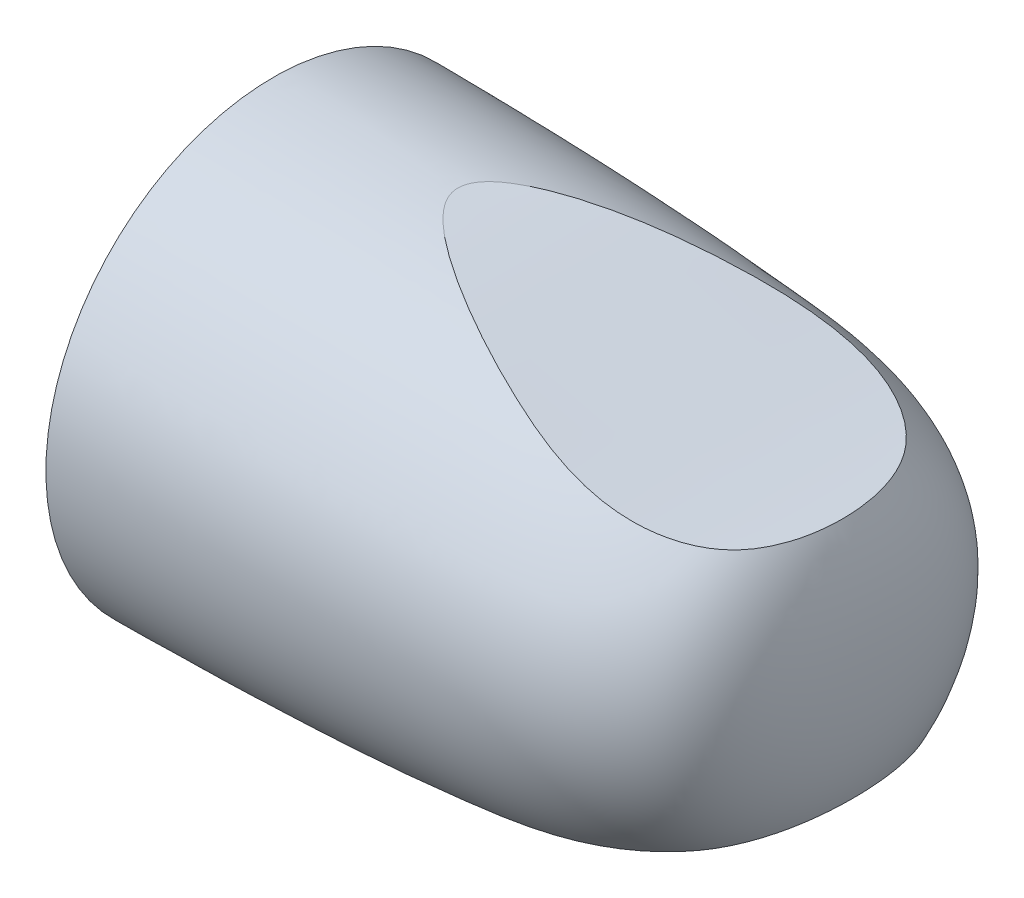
ISO-10303-21;
HEADER;
FILE_DESCRIPTION(('STEP AP214'),'2;1');
FILE_NAME('part.step','',(''),(''),'','','');
FILE_SCHEMA(('AUTOMOTIVE_DESIGN { 1 0 10303 214 1 1 1 1 }'));
ENDSEC;
DATA;
#1=APPLICATION_CONTEXT('core data for automotive mechanical design processes');
#2=APPLICATION_PROTOCOL_DEFINITION('international standard','automotive_design',2000,#1);
#3=PRODUCT_CONTEXT('',#1,'mechanical');
#4=PRODUCT('Part','Part','',(#3));
#5=PRODUCT_RELATED_PRODUCT_CATEGORY('part','',(#4));
#6=PRODUCT_DEFINITION_FORMATION('','',#4);
#7=PRODUCT_DEFINITION_CONTEXT('part definition',#1,'design');
#8=PRODUCT_DEFINITION('design','',#6,#7);
#9=PRODUCT_DEFINITION_SHAPE('','',#8);
#10=(LENGTH_UNIT() NAMED_UNIT(*) SI_UNIT(.MILLI.,.METRE.));
#11=(NAMED_UNIT(*) PLANE_ANGLE_UNIT() SI_UNIT($,.RADIAN.));
#12=(NAMED_UNIT(*) SI_UNIT($,.STERADIAN.) SOLID_ANGLE_UNIT());
#13=UNCERTAINTY_MEASURE_WITH_UNIT(LENGTH_MEASURE(1.E-05),#10,'distance_accuracy_value','');
#14=(GEOMETRIC_REPRESENTATION_CONTEXT(3) GLOBAL_UNCERTAINTY_ASSIGNED_CONTEXT((#13)) GLOBAL_UNIT_ASSIGNED_CONTEXT((#10,
#11,#12)) REPRESENTATION_CONTEXT('',''));
#15=CARTESIAN_POINT('',(0.,0.,0.));
#16=DIRECTION('',(0.,0.,1.));
#17=DIRECTION('',(1.,0.,0.));
#18=AXIS2_PLACEMENT_3D('',#15,#16,#17);
#19=CARTESIAN_POINT('',(-3.81639164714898E-13,11.45,-11.45));
#20=CARTESIAN_POINT('',(12.6240109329,13.3553152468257,-11.45));
#21=CARTESIAN_POINT('',(23.840470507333,5.07974875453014,-11.45));
#22=CARTESIAN_POINT('',(36.4896849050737,6.11841475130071,-11.45));
#23=B_SPLINE_CURVE_WITH_KNOTS('',3,(#19,#20,#21,#22),.UNSPECIFIED.,.F.,.F.,(4,4),(0.,1.),.UNSPECIFIED.);
#24=DIRECTION('',(0.,0.,1.));
#25=VECTOR('',#24,1.);
#26=SURFACE_OF_LINEAR_EXTRUSION('',#23,#25);
#27=OFFSET_SURFACE('',#26,3.,.F.);
#28=CARTESIAN_POINT('',(24.4551561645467,4.31586429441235,4.78310390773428));
#29=CARTESIAN_POINT('',(24.3329693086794,4.3447553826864,4.84309589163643));
#30=CARTESIAN_POINT('',(24.2083745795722,4.37455764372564,4.89781841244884));
#31=CARTESIAN_POINT('',(23.9554583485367,4.43575717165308,4.99714047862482));
#32=CARTESIAN_POINT('',(23.8271324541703,4.46715635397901,5.04172749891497));
#33=CARTESIAN_POINT('',(23.5678551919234,4.53128977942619,5.12139634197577));
#34=CARTESIAN_POINT('',(23.4369028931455,4.56402450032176,5.15647472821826));
#35=CARTESIAN_POINT('',(23.1725073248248,4.63078591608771,5.21806601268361));
#36=CARTESIAN_POINT('',(23.0390540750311,4.66481894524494,5.2445286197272));
#37=CARTESIAN_POINT('',(22.7711139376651,4.73378676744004,5.28943944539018));
#38=CARTESIAN_POINT('',(22.6366275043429,4.76872117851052,5.30789100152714));
#39=CARTESIAN_POINT('',(22.3670864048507,4.83933052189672,5.33759669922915));
#40=CARTESIAN_POINT('',(22.2320317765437,4.87500540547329,5.34885131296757));
#41=CARTESIAN_POINT('',(21.8253859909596,4.98324040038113,5.37303528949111));
#42=CARTESIAN_POINT('',(21.5534406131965,5.05671983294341,5.37620958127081));
#43=CARTESIAN_POINT('',(21.0103111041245,5.20522976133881,5.36183707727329));
#44=CARTESIAN_POINT('',(20.7391284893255,5.28026221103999,5.34426239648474));
#45=CARTESIAN_POINT('',(20.1984380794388,5.43116087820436,5.29250325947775));
#46=CARTESIAN_POINT('',(19.9289316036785,5.50702764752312,5.25830707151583));
#47=CARTESIAN_POINT('',(19.3914107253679,5.65918031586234,5.17660088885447));
#48=CARTESIAN_POINT('',(19.123401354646,5.73546678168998,5.12905961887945));
#49=CARTESIAN_POINT('',(18.723029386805,5.84971853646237,5.05000526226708));
#50=CARTESIAN_POINT('',(18.5898995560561,5.88775736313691,5.02237621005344));
#51=CARTESIAN_POINT('',(18.32409974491,5.96374416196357,4.96486178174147));
#52=CARTESIAN_POINT('',(18.191429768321,6.0016921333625,4.93497638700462));
#53=CARTESIAN_POINT('',(17.926517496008,6.07745048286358,4.87331450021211));
#54=CARTESIAN_POINT('',(17.7942751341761,6.1152608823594,4.84153831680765));
#55=CARTESIAN_POINT('',(17.5301543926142,6.19070696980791,4.77631703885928));
#56=CARTESIAN_POINT('',(17.3982760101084,6.2283426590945,4.74287195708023));
#57=CARTESIAN_POINT('',(17.0505153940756,6.32742106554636,4.65227500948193));
#58=CARTESIAN_POINT('',(16.8349544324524,6.3886656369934,4.59366485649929));
#59=CARTESIAN_POINT('',(16.4049141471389,6.51026804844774,4.47173002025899));
#60=CARTESIAN_POINT('',(16.1904348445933,6.57062587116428,4.4084052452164));
#61=CARTESIAN_POINT('',(15.7626075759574,6.69020652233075,4.2769097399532));
#62=CARTESIAN_POINT('',(15.549259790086,6.74942917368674,4.20873826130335));
#63=CARTESIAN_POINT('',(15.1238541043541,6.86646729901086,4.06741873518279));
#64=CARTESIAN_POINT('',(14.9117960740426,6.92428291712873,3.99427120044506));
#65=CARTESIAN_POINT('',(14.4891113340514,7.03824917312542,3.84280538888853));
#66=CARTESIAN_POINT('',(14.2784844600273,7.09440000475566,3.76448771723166));
#67=CARTESIAN_POINT('',(13.8589267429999,7.20475766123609,3.60244483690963));
#68=CARTESIAN_POINT('',(13.6499951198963,7.25896542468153,3.51872229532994));
#69=CARTESIAN_POINT('',(13.2848370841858,7.35221736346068,3.36662731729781));
#70=CARTESIAN_POINT('',(13.1282093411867,7.39172960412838,3.29950420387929));
#71=CARTESIAN_POINT('',(12.8161645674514,7.46939573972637,3.16169235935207));
#72=CARTESIAN_POINT('',(12.6607476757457,7.50754948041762,3.09100322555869));
#73=CARTESIAN_POINT('',(12.3512300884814,7.58240286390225,2.94569158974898));
#74=CARTESIAN_POINT('',(12.1971306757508,7.61910119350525,2.87106567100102));
#75=CARTESIAN_POINT('',(11.8904201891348,7.69094083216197,2.71736084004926));
#76=CARTESIAN_POINT('',(11.7378124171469,7.72607911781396,2.63827390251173));
#77=CARTESIAN_POINT('',(11.4348444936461,7.79457438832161,2.47515256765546));
#78=CARTESIAN_POINT('',(11.2844843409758,7.82793137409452,2.39111817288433));
#79=CARTESIAN_POINT('',(10.9868056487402,7.89266690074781,2.21722337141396));
#80=CARTESIAN_POINT('',(10.8394859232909,7.92404622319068,2.12736529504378));
#81=CARTESIAN_POINT('',(10.5493216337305,7.98453370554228,1.94062683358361));
#82=CARTESIAN_POINT('',(10.4064672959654,8.01364706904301,1.84376358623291));
#83=CARTESIAN_POINT('',(10.1970598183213,8.05536322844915,1.6915117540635));
#84=CARTESIAN_POINT('',(10.1281319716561,8.06893116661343,1.63965348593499));
#85=CARTESIAN_POINT('',(9.99230369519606,8.09535557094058,1.53318362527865));
#86=CARTESIAN_POINT('',(9.92540289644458,8.10821216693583,1.47857253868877));
#87=CARTESIAN_POINT('',(9.79006113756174,8.13391394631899,1.36250600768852));
#88=CARTESIAN_POINT('',(9.7217926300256,8.14670644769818,1.30083615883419));
#89=CARTESIAN_POINT('',(9.5892722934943,8.17122974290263,1.17291349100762));
#90=CARTESIAN_POINT('',(9.52502526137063,8.18295927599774,1.10665539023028));
#91=CARTESIAN_POINT('',(9.4031047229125,8.20495247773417,0.969379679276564));
#92=CARTESIAN_POINT('',(9.34536668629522,8.21523085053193,0.898422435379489));
#93=CARTESIAN_POINT('',(9.23854400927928,8.23404444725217,0.750092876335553));
#94=CARTESIAN_POINT('',(9.1894366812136,8.24258425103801,0.672738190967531));
#95=CARTESIAN_POINT('',(9.13028684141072,8.25278525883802,0.560487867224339));
#96=CARTESIAN_POINT('',(9.1147264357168,8.25545815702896,0.528572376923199));
#97=CARTESIAN_POINT('',(9.08588426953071,8.26039776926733,0.463688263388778));
#98=CARTESIAN_POINT('',(9.07260240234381,8.26266450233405,0.430719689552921));
#99=CARTESIAN_POINT('',(9.04866688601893,8.26673945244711,0.363832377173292));
#100=CARTESIAN_POINT('',(9.03801147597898,8.26854797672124,0.329914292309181));
#101=CARTESIAN_POINT('',(9.01965336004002,8.27165832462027,0.261267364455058));
#102=CARTESIAN_POINT('',(9.01194987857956,8.27296028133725,0.22653873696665));
#103=CARTESIAN_POINT('',(8.99970913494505,8.27502692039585,0.156118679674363));
#104=CARTESIAN_POINT('',(8.99520697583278,8.2757856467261,0.120420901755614));
#105=CARTESIAN_POINT('',(8.98969432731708,8.27671444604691,0.0487483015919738));
#106=CARTESIAN_POINT('',(8.98868363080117,8.27688455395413,0.0127734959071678));
#107=CARTESIAN_POINT('',(8.99019834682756,8.27662946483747,-0.0591084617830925));
#108=CARTESIAN_POINT('',(8.99272470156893,8.27620410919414,-0.0950155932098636));
#109=CARTESIAN_POINT('',(9.00120486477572,8.27477433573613,-0.166409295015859));
#110=CARTESIAN_POINT('',(9.00715903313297,8.27376985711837,-0.201895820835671));
#111=CARTESIAN_POINT('',(9.02278289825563,8.27112845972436,-0.274607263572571));
#112=CARTESIAN_POINT('',(9.0326825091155,8.26945236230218,-0.311781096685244));
#113=CARTESIAN_POINT('',(9.05573957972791,8.26553675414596,-0.3850833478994));
#114=CARTESIAN_POINT('',(9.06889919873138,8.26329686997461,-0.421211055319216));
#115=CARTESIAN_POINT('',(9.11264858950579,8.25582285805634,-0.527874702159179));
#116=CARTESIAN_POINT('',(9.14749386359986,8.24983688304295,-0.596627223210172));
#117=CARTESIAN_POINT('',(9.22016898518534,8.23723072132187,-0.720425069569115));
#118=CARTESIAN_POINT('',(9.25701880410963,8.23079471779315,-0.776089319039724));
#119=CARTESIAN_POINT('',(9.33528291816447,8.2170022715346,-0.884037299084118));
#120=CARTESIAN_POINT('',(9.37670104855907,8.20964505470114,-0.936318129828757));
#121=CARTESIAN_POINT('',(9.46303720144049,8.19416434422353,-1.03798451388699));
#122=CARTESIAN_POINT('',(9.50796403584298,8.18603890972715,-1.08736219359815));
#123=CARTESIAN_POINT('',(9.60039559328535,8.16916069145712,-1.18347374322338));
#124=CARTESIAN_POINT('',(9.64789932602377,8.16040814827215,-1.23020861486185));
#125=CARTESIAN_POINT('',(9.75004723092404,8.14140517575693,-1.32623156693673));
#126=CARTESIAN_POINT('',(9.80491563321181,8.13109418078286,-1.37526793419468));
#127=CARTESIAN_POINT('',(9.91657407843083,8.10988761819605,-1.4709777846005));
#128=CARTESIAN_POINT('',(9.97336453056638,8.09899192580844,-1.51765075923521));
#129=CARTESIAN_POINT('',(10.1461937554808,8.06548438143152,-1.65477383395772));
#130=CARTESIAN_POINT('',(10.264509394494,8.04208563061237,-1.74216300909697));
#131=CARTESIAN_POINT('',(10.5052514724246,7.99350101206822,-1.91072741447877));
#132=CARTESIAN_POINT('',(10.6276820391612,7.96831331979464,-1.9918961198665));
#133=CARTESIAN_POINT('',(10.8762042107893,7.91620703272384,-2.14964422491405));
#134=CARTESIAN_POINT('',(11.0023139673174,7.88927856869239,-2.22619163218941));
#135=CARTESIAN_POINT('',(11.2565527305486,7.83402061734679,-2.3748881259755));
#136=CARTESIAN_POINT('',(11.3846788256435,7.80569304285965,-2.44704293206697));
#137=CARTESIAN_POINT('',(11.6425666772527,7.74773735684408,-2.58760974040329));
#138=CARTESIAN_POINT('',(11.7723273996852,7.71811004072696,-2.656023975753));
#139=CARTESIAN_POINT('',(12.0676286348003,7.64966529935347,-2.80718864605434));
#140=CARTESIAN_POINT('',(12.2335837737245,7.61048411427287,-2.88896400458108));
#141=CARTESIAN_POINT('',(12.567273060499,7.53034801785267,-3.04789671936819));
#142=CARTESIAN_POINT('',(12.7350073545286,7.48939295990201,-3.12505369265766));
#143=CARTESIAN_POINT('',(13.2407775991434,7.36401417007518,-3.35041176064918));
#144=CARTESIAN_POINT('',(13.5810277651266,7.27715902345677,-3.49232199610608));
#145=CARTESIAN_POINT('',(14.2664581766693,7.09801793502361,-3.76166113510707));
#146=CARTESIAN_POINT('',(14.6116458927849,7.00572291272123,-3.88906472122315));
#147=CARTESIAN_POINT('',(15.3061330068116,6.8168270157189,-4.13041909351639));
#148=CARTESIAN_POINT('',(15.6554376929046,6.72022002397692,-4.24434987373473));
#149=CARTESIAN_POINT('',(16.1811179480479,6.57319677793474,-4.4053275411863));
#150=CARTESIAN_POINT('',(16.356336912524,6.52392121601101,-4.45725493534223));
#151=CARTESIAN_POINT('',(16.7075100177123,6.4247530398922,-4.55794998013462));
#152=CARTESIAN_POINT('',(16.8834641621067,6.37486042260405,-4.60671761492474));
#153=CARTESIAN_POINT('',(17.2358873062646,6.27465049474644,-4.70109504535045));
#154=CARTESIAN_POINT('',(17.4123555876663,6.22433367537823,-4.74670804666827));
#155=CARTESIAN_POINT('',(17.6775541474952,6.14860781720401,-4.81284606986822));
#156=CARTESIAN_POINT('',(17.766037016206,6.12332390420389,-4.83451198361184));
#157=CARTESIAN_POINT('',(17.943169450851,6.07268877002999,-4.87706951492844));
#158=CARTESIAN_POINT('',(18.0318190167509,6.04733754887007,-4.89796113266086));
#159=CARTESIAN_POINT('',(18.2977443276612,5.9712860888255,-4.95923973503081));
#160=CARTESIAN_POINT('',(18.4753031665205,5.92050042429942,-4.99830751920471));
#161=CARTESIAN_POINT('',(18.8312865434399,5.81880359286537,-5.07212858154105));
#162=CARTESIAN_POINT('',(19.0097110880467,5.76789242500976,-5.10688182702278));
#163=CARTESIAN_POINT('',(19.3673035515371,5.66611570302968,-5.17120582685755));
#164=CARTESIAN_POINT('',(19.5464704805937,5.61525015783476,-5.20078204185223));
#165=CARTESIAN_POINT('',(19.9057267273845,5.51365143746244,-5.25389597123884));
#166=CARTESIAN_POINT('',(20.0858159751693,5.46291825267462,-5.27743413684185));
#167=CARTESIAN_POINT('',(20.4847217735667,5.35113024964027,-5.32167414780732));
#168=CARTESIAN_POINT('',(20.7037434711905,5.29014095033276,-5.34074728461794));
#169=CARTESIAN_POINT('',(21.142820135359,5.16889893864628,-5.36655449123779));
#170=CARTESIAN_POINT('',(21.3628753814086,5.10864644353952,-5.3732850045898));
#171=CARTESIAN_POINT('',(21.802068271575,4.98965435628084,-5.37193016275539));
#172=CARTESIAN_POINT('',(22.0212039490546,4.93090807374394,-5.36392947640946));
#173=CARTESIAN_POINT('',(22.4584985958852,4.8151453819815,-5.33040479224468));
#174=CARTESIAN_POINT('',(22.6766580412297,4.75812802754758,-5.30489055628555));
#175=CARTESIAN_POINT('',(23.148750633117,4.63655143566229,-5.22656831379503));
#176=CARTESIAN_POINT('',(23.4021899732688,4.5724408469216,-5.1697326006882));
#177=CARTESIAN_POINT('',(23.7758879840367,4.47976705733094,-5.05843239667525));
#178=CARTESIAN_POINT('',(23.8996075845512,4.44940309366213,-5.01688664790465));
#179=CARTESIAN_POINT('',(24.1438745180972,4.3900859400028,-4.92446332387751));
#180=CARTESIAN_POINT('',(24.2644226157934,4.36113240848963,-4.87358802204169));
#181=CARTESIAN_POINT('',(24.4640973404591,4.31370071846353,-4.77963680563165));
#182=CARTESIAN_POINT('',(24.5443398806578,4.29478908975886,-4.73913141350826));
#183=CARTESIAN_POINT('',(24.7025110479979,4.25779980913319,-4.65342801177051));
#184=CARTESIAN_POINT('',(24.7804393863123,4.23972226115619,-4.6082294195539));
#185=CARTESIAN_POINT('',(24.9327821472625,4.20465836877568,-4.51276364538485));
#186=CARTESIAN_POINT('',(25.0072136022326,4.18766654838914,-4.46252584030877));
#187=CARTESIAN_POINT('',(25.151993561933,4.15486951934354,-4.35608976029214));
#188=CARTESIAN_POINT('',(25.2223434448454,4.1390639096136,-4.29989351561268));
#189=CARTESIAN_POINT('',(25.327774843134,4.11555159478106,-4.20694496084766));
#190=CARTESIAN_POINT('',(25.3647772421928,4.10733642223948,-4.17249150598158));
#191=CARTESIAN_POINT('',(25.4366750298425,4.09143886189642,-4.10133603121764));
#192=CARTESIAN_POINT('',(25.4715709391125,4.08375634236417,-4.06463457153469));
#193=CARTESIAN_POINT('',(25.5387759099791,4.06901773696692,-3.98884500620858));
#194=CARTESIAN_POINT('',(25.5710861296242,4.06196137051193,-3.94975798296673));
#195=CARTESIAN_POINT('',(25.633231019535,4.04843813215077,-3.86950969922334));
#196=CARTESIAN_POINT('',(25.6630630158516,4.04197189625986,-3.82834627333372));
#197=CARTESIAN_POINT('',(25.7203944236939,4.02958699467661,-3.74430949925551));
#198=CARTESIAN_POINT('',(25.7478921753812,4.02366871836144,-3.70143496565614));
#199=CARTESIAN_POINT('',(25.8007032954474,4.01233832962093,-3.61428251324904));
#200=CARTESIAN_POINT('',(25.8260158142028,4.00692641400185,-3.57000405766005));
#201=CARTESIAN_POINT('',(25.9086719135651,3.98930585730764,-3.41747870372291));
#202=CARTESIAN_POINT('',(25.9612269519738,3.97819334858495,-3.30649187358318));
#203=CARTESIAN_POINT('',(26.0568198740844,3.9580928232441,-3.08037896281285));
#204=CARTESIAN_POINT('',(26.0998539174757,3.94910566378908,-2.96525123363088));
#205=CARTESIAN_POINT('',(26.1782903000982,3.93280162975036,-2.73153925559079));
#206=CARTESIAN_POINT('',(26.2136437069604,3.92549544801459,-2.61293801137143));
#207=CARTESIAN_POINT('',(26.2776301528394,3.91232341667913,-2.37384594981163));
#208=CARTESIAN_POINT('',(26.3062609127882,3.90645805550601,-2.25335450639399));
#209=CARTESIAN_POINT('',(26.3696259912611,3.89351742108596,-1.95514316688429));
#210=CARTESIAN_POINT('',(26.4010714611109,3.88713460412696,-1.77669559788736));
#211=CARTESIAN_POINT('',(26.4536521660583,3.87649300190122,-1.41811932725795));
#212=CARTESIAN_POINT('',(26.4747785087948,3.87223604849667,-1.23798931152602));
#213=CARTESIAN_POINT('',(26.5079544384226,3.86556256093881,-0.876763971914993));
#214=CARTESIAN_POINT('',(26.5199984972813,3.86314714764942,-0.695668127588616));
#215=CARTESIAN_POINT('',(26.5356606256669,3.86000776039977,-0.333729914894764));
#216=CARTESIAN_POINT('',(26.5393075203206,3.85927800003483,-0.152888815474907));
#217=CARTESIAN_POINT('',(26.5384655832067,3.85944659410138,0.208650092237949));
#218=CARTESIAN_POINT('',(26.533982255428,3.86034384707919,0.38934791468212));
#219=CARTESIAN_POINT('',(26.5166439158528,3.86382002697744,0.750252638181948));
#220=CARTESIAN_POINT('',(26.5037929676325,3.86639813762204,0.930459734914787));
#221=CARTESIAN_POINT('',(26.4742548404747,3.87234286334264,1.23541510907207));
#222=CARTESIAN_POINT('',(26.4599143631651,3.87523295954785,1.36040199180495));
#223=CARTESIAN_POINT('',(26.4263863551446,3.8820085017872,1.60971168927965));
#224=CARTESIAN_POINT('',(26.4071986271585,3.88589398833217,1.73403447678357));
#225=CARTESIAN_POINT('',(26.3633446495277,3.89480510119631,1.98202306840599));
#226=CARTESIAN_POINT('',(26.3386638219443,3.89983376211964,2.10568621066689));
#227=CARTESIAN_POINT('',(26.283069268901,3.91120952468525,2.35154336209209));
#228=CARTESIAN_POINT('',(26.2521566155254,3.91755639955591,2.47373762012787));
#229=CARTESIAN_POINT('',(26.1891023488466,3.93057009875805,2.69468331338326));
#230=CARTESIAN_POINT('',(26.1581308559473,3.93698479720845,2.79378161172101));
#231=CARTESIAN_POINT('',(26.0904235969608,3.9510771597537,2.98995634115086));
#232=CARTESIAN_POINT('',(26.0536862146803,3.95875517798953,3.08703219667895));
#233=CARTESIAN_POINT('',(25.9737164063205,3.97556410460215,3.27762308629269));
#234=CARTESIAN_POINT('',(25.9305277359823,3.98468524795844,3.37115715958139));
#235=CARTESIAN_POINT('',(25.8362640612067,4.00472320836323,3.5539921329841));
#236=CARTESIAN_POINT('',(25.7851939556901,4.01563891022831,3.64329561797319));
#237=CARTESIAN_POINT('',(25.7008097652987,4.0338112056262,3.77382365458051));
#238=CARTESIAN_POINT('',(25.6708924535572,4.04027580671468,3.81736556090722));
#239=CARTESIAN_POINT('',(25.6084340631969,4.05382585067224,3.90242434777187));
#240=CARTESIAN_POINT('',(25.5758936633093,4.06091113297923,3.94394174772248));
#241=CARTESIAN_POINT('',(25.5080028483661,4.07575659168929,4.024455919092));
#242=CARTESIAN_POINT('',(25.4726536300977,4.08351648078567,4.06345375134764));
#243=CARTESIAN_POINT('',(25.3994467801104,4.09965896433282,4.13900084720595));
#244=CARTESIAN_POINT('',(25.3615848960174,4.10804261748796,4.17554573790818));
#245=CARTESIAN_POINT('',(25.2838396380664,4.12533703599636,4.24633275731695));
#246=CARTESIAN_POINT('',(25.2439548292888,4.13424817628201,4.28057321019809));
#247=CARTESIAN_POINT('',(25.1625098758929,4.15253023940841,4.34687403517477));
#248=CARTESIAN_POINT('',(25.1209494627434,4.16190123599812,4.37893405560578));
#249=CARTESIAN_POINT('',(25.0296518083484,4.1825844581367,4.44600419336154));
#250=CARTESIAN_POINT('',(24.979672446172,4.19396692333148,4.48066242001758));
#251=CARTESIAN_POINT('',(24.8782004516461,4.21720398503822,4.54744624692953));
#252=CARTESIAN_POINT('',(24.8267085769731,4.22905834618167,4.57957308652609));
#253=CARTESIAN_POINT('',(24.7224836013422,4.25318422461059,4.64149409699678));
#254=CARTESIAN_POINT('',(24.6697512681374,4.26545548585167,4.67128966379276));
#255=CARTESIAN_POINT('',(24.563223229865,4.29037926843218,4.7287717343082));
#256=CARTESIAN_POINT('',(24.5094272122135,4.30303190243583,4.75645760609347));
#257=CARTESIAN_POINT('',(24.4551561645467,4.31586429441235,4.78310390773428));
#258=B_SPLINE_CURVE_WITH_KNOTS('',3,(#28,#29,#30,#31,#32,#33,#34,#35,#36,#37,#38,#39,#40,#41,
#42,#43,#44,#45,#46,#47,#48,#49,#50,#51,#52,#53,#54,#55,#56,#57,#58,#59,#60,#61,#62,#63,#64,#65,
#66,#67,#68,#69,#70,#71,#72,#73,#74,#75,#76,#77,#78,#79,#80,#81,#82,#83,#84,#85,#86,#87,#88,#89,
#90,#91,#92,#93,#94,#95,#96,#97,#98,#99,#100,#101,#102,#103,#104,#105,#106,#107,#108,#109,#110,
#111,#112,#113,#114,#115,#116,#117,#118,#119,#120,#121,#122,#123,#124,#125,#126,#127,#128,#129,
#130,#131,#132,#133,#134,#135,#136,#137,#138,#139,#140,#141,#142,#143,#144,#145,#146,#147,#148,
#149,#150,#151,#152,#153,#154,#155,#156,#157,#158,#159,#160,#161,#162,#163,#164,#165,#166,#167,
#168,#169,#170,#171,#172,#173,#174,#175,#176,#177,#178,#179,#180,#181,#182,#183,#184,#185,#186,
#187,#188,#189,#190,#191,#192,#193,#194,#195,#196,#197,#198,#199,#200,#201,#202,#203,#204,#205,
#206,#207,#208,#209,#210,#211,#212,#213,#214,#215,#216,#217,#218,#219,#220,#221,#222,#223,#224,
#225,#226,#227,#228,#229,#230,#231,#232,#233,#234,#235,#236,#237,#238,#239,#240,#241,#242,#243,
#244,#245,#246,#247,#248,#249,#250,#251,#252,#253,#254,#255,#256,#257),.UNSPECIFIED.,.T.,.F.,(4,
2,2,2,2,2,2,2,2,2,2,2,2,2,2,2,2,2,2,2,2,2,2,2,2,2,2,2,2,2,2,2,2,2,2,2,2,2,2,2,2,2,2,2,2,2,2,2,2,
2,2,2,2,2,2,2,2,2,2,2,2,2,2,2,2,2,2,2,2,2,2,2,2,2,2,2,2,2,2,2,2,2,2,2,2,2,2,2,2,2,2,2,2,2,2,2,2,
2,2,2,2,2,2,2,2,2,2,2,2,2,2,2,2,2,4),(0.,0.417407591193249,0.83532822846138,1.25339970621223,
1.67386949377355,2.09416393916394,2.51443080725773,3.35848284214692,4.20367051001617,
5.04945559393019,5.89723963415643,6.32078728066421,6.74433842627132,7.1678206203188,
7.59129957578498,8.28613600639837,8.9809859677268,9.67594346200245,10.3708294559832,
11.0656342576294,11.7600987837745,12.2848354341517,12.8096314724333,13.3348907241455,
13.8611270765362,14.3873631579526,14.9133899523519,15.4381707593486,15.7000708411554,
15.9619229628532,16.2404212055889,16.5192455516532,16.7950030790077,17.0700245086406,
17.1767731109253,17.2835167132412,17.3901885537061,17.4968323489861,17.6046281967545,
17.7124176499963,17.8202358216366,17.9280653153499,18.0434055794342,18.1588224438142,
18.3898508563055,18.5907852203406,18.7918895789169,18.9935163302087,19.1950661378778,
19.417904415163,19.6407904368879,20.0873024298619,20.5342765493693,20.9840553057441,
21.4332352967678,21.88214413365,22.4493923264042,23.0166874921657,24.1524881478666,
25.2902415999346,26.4296638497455,26.9974755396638,27.5652900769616,28.132518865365,
28.4161374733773,28.69975602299,29.2660094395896,29.8322671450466,30.397923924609,
30.9635384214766,31.6477116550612,32.3320819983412,33.0125311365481,33.692601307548,
34.4928966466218,34.8945840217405,35.2961736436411,35.5716071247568,35.8470748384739,
36.1210209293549,36.3948739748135,36.5484639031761,36.7020157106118,36.855498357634,
37.0091445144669,37.1628990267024,37.3167130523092,37.6859438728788,38.0553233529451,
38.4269912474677,38.7987849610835,39.3423040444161,39.8862906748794,40.4306081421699,
40.9730543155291,41.5151334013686,42.0569494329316,42.4343859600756,42.8118378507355,
43.1903036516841,43.5687043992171,43.8806231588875,44.192629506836,44.5026084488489,
44.812395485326,44.9719799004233,45.1315231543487,45.2909987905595,45.4507515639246,
45.6106192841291,45.7705127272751,45.9560583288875,46.1415125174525,46.3268547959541,
46.5122523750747),.UNSPECIFIED.);
#259=CARTESIAN_POINT('',(24.4551561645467,4.31586429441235,4.78310390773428));
#260=VERTEX_POINT('',#259);
#261=EDGE_CURVE('E79',#260,#260,#258,.T.);
#262=ORIENTED_EDGE('',*,*,#261,.T.);
#263=EDGE_LOOP('',(#262));
#264=FACE_BOUND('',#263,.T.);
#265=ADVANCED_FACE('F36',(#264),#27,.T.);
#266=CARTESIAN_POINT('',(-9.71872068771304,-8.48659923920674,-11.45));
#267=DIRECTION('',(-0.155726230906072,0.987800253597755,0.));
#268=DIRECTION('',(-0.987800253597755,-0.155726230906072,0.));
#269=AXIS2_PLACEMENT_3D('',#266,#267,#268);
#270=PLANE('',#269);
#271=CARTESIAN_POINT('',(1.15133573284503E-05,-6.95444582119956,4.79975456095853));
#272=CARTESIAN_POINT('',(0.216840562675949,-6.92026282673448,4.84751165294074));
#273=CARTESIAN_POINT('',(0.433958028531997,-6.88603436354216,4.89390962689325));
#274=CARTESIAN_POINT('',(0.868706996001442,-6.81749639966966,4.98414802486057));
#275=CARTESIAN_POINT('',(1.08633848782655,-6.78318690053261,5.02798849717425));
#276=CARTESIAN_POINT('',(1.73960472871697,-6.68019979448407,5.15585518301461));
#277=CARTESIAN_POINT('',(2.1759272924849,-6.61141375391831,5.23629576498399));
#278=CARTESIAN_POINT('',(3.04985508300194,-6.47363946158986,5.38856268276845));
#279=CARTESIAN_POINT('',(3.48745975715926,-6.40465129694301,5.46039229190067));
#280=CARTESIAN_POINT('',(4.36377526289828,-6.26650058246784,5.59620570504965));
#281=CARTESIAN_POINT('',(4.80248589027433,-6.19733806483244,5.66019086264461));
#282=CARTESIAN_POINT('',(5.68085521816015,-6.05886356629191,5.7809089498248));
#283=CARTESIAN_POINT('',(6.12051387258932,-5.98955159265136,5.83764222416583));
#284=CARTESIAN_POINT('',(7.00064150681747,-5.85079989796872,5.94432398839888));
#285=CARTESIAN_POINT('',(7.44111050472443,-5.78136017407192,5.99427232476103));
#286=CARTESIAN_POINT('',(8.34268830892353,-5.63922687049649,6.08987647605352));
#287=CARTESIAN_POINT('',(8.80382780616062,-5.56652845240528,6.1352351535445));
#288=CARTESIAN_POINT('',(9.72673879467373,-5.42103198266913,6.21930273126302));
#289=CARTESIAN_POINT('',(10.1885103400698,-5.3482339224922,6.25801102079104));
#290=CARTESIAN_POINT('',(11.1125490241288,-5.20255967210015,6.32906654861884));
#291=CARTESIAN_POINT('',(11.5748161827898,-5.12968347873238,6.36141351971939));
#292=CARTESIAN_POINT('',(12.4997120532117,-4.98387409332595,6.4199909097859));
#293=CARTESIAN_POINT('',(12.9623407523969,-4.91094090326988,6.44622153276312));
#294=CARTESIAN_POINT('',(13.8878271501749,-4.76503842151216,6.4927789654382));
#295=CARTESIAN_POINT('',(14.3506848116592,-4.69206913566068,6.51310653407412));
#296=CARTESIAN_POINT('',(15.276499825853,-4.5461148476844,6.54804289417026));
#297=CARTESIAN_POINT('',(15.7394571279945,-4.47312985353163,6.56265305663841));
#298=CARTESIAN_POINT('',(16.4510541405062,-4.36094692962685,6.58085383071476));
#299=CARTESIAN_POINT('',(16.6996463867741,-4.32175648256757,6.58641414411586));
#300=CARTESIAN_POINT('',(17.1968801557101,-4.24336782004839,6.59594871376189));
#301=CARTESIAN_POINT('',(17.4455216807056,-4.20416960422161,6.59992284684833));
#302=CARTESIAN_POINT('',(17.8185497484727,-4.14536191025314,6.60475767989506));
#303=CARTESIAN_POINT('',(17.9429293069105,-4.12575353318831,6.6061817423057));
#304=CARTESIAN_POINT('',(18.1916931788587,-4.08653602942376,6.608487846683));
#305=CARTESIAN_POINT('',(18.3160774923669,-4.06692690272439,6.60936988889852));
#306=CARTESIAN_POINT('',(18.6894426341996,-4.00806606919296,6.61083943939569));
#307=CARTESIAN_POINT('',(18.9384314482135,-3.96881310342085,6.61024698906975));
#308=CARTESIAN_POINT('',(19.4344021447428,-3.89062356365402,6.60401172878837));
#309=CARTESIAN_POINT('',(19.6813844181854,-3.85168692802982,6.59840865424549));
#310=CARTESIAN_POINT('',(20.1750271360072,-3.77386439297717,6.58011824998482));
#311=CARTESIAN_POINT('',(20.4216876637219,-3.73497848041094,6.56743344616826));
#312=CARTESIAN_POINT('',(20.9141047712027,-3.65734916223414,6.53263416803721));
#313=CARTESIAN_POINT('',(21.1598620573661,-3.61860564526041,6.51053036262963));
#314=CARTESIAN_POINT('',(21.6499086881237,-3.54135003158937,6.45417437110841));
#315=CARTESIAN_POINT('',(21.8941989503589,-3.50283779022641,6.41993081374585));
#316=CARTESIAN_POINT('',(22.2742908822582,-3.44291648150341,6.35436945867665));
#317=CARTESIAN_POINT('',(22.4109751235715,-3.42136827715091,6.32828040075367));
#318=CARTESIAN_POINT('',(22.683243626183,-3.37844527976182,6.27056439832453));
#319=CARTESIAN_POINT('',(22.818827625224,-3.35707052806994,6.23893617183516));
#320=CARTESIAN_POINT('',(23.0884915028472,-3.31455814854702,6.16946158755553));
#321=CARTESIAN_POINT('',(23.2225708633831,-3.29342060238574,6.13161315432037));
#322=CARTESIAN_POINT('',(23.4889118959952,-3.25143206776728,6.04893086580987));
#323=CARTESIAN_POINT('',(23.6211695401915,-3.23058171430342,6.00408361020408));
#324=CARTESIAN_POINT('',(23.8829046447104,-3.18931930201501,5.90680303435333));
#325=CARTESIAN_POINT('',(24.0123828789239,-3.16890712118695,5.85437185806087));
#326=CARTESIAN_POINT('',(24.2677276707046,-3.1286521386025,5.74135087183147));
#327=CARTESIAN_POINT('',(24.3935970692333,-3.10880888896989,5.68076770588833));
#328=CARTESIAN_POINT('',(24.5629482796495,-3.08211075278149,5.59195384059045));
#329=CARTESIAN_POINT('',(24.6083376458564,-3.07495514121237,5.56740908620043));
#330=CARTESIAN_POINT('',(24.698452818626,-3.06074852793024,5.51710308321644));
#331=CARTESIAN_POINT('',(24.7431786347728,-3.05369752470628,5.49134185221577));
#332=CARTESIAN_POINT('',(24.8762638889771,-3.03271669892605,5.41202964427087));
#333=CARTESIAN_POINT('',(24.9634804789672,-3.01896704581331,5.35647639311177));
#334=CARTESIAN_POINT('',(25.132904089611,-2.99225749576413,5.23955358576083));
#335=CARTESIAN_POINT('',(25.215149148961,-2.97929160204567,5.17824091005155));
#336=CARTESIAN_POINT('',(25.3735317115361,-2.95432266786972,5.04808634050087));
#337=CARTESIAN_POINT('',(25.4496800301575,-2.94231792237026,4.97925831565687));
#338=CARTESIAN_POINT('',(25.5937337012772,-2.91960793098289,4.83094072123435));
#339=CARTESIAN_POINT('',(25.6614813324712,-2.90892754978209,4.75129321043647));
#340=CARTESIAN_POINT('',(25.7878311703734,-2.88900855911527,4.5848146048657));
#341=CARTESIAN_POINT('',(25.8464181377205,-2.87977235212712,4.49797189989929));
#342=CARTESIAN_POINT('',(25.955904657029,-2.86251185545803,4.31856398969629));
#343=CARTESIAN_POINT('',(26.006739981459,-2.85449769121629,4.22595907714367));
#344=CARTESIAN_POINT('',(26.1012900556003,-2.83959191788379,4.03718110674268));
#345=CARTESIAN_POINT('',(26.1450073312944,-2.83269991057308,3.9410093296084));
#346=CARTESIAN_POINT('',(26.2206136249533,-2.82078061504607,3.75980525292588));
#347=CARTESIAN_POINT('',(26.2533014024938,-2.81562740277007,3.6751104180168));
#348=CARTESIAN_POINT('',(26.314699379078,-2.80594804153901,3.50424866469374));
#349=CARTESIAN_POINT('',(26.3434088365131,-2.80142200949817,3.41808147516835));
#350=CARTESIAN_POINT('',(26.4242818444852,-2.78867241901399,3.15779553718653));
#351=CARTESIAN_POINT('',(26.4711529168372,-2.78128321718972,2.98198464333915));
#352=CARTESIAN_POINT('',(26.5535840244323,-2.76828799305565,2.62739777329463));
#353=CARTESIAN_POINT('',(26.589122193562,-2.76268541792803,2.44861675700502));
#354=CARTESIAN_POINT('',(26.6506817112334,-2.7529805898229,2.08949832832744));
#355=CARTESIAN_POINT('',(26.6767075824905,-2.74887762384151,1.90916169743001));
#356=CARTESIAN_POINT('',(26.7314398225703,-2.74024911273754,1.45899031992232));
#357=CARTESIAN_POINT('',(26.7552252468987,-2.73649935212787,1.1885452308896));
#358=CARTESIAN_POINT('',(26.7877943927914,-2.73136484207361,0.646505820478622));
#359=CARTESIAN_POINT('',(26.7965624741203,-2.72998255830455,0.374910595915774));
#360=CARTESIAN_POINT('',(26.8001386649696,-2.72941877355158,-0.168883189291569));
#361=CARTESIAN_POINT('',(26.7949202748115,-2.73024145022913,-0.441081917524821));
#362=CARTESIAN_POINT('',(26.769804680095,-2.73420091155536,-0.985185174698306));
#363=CARTESIAN_POINT('',(26.7498889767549,-2.73734061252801,-1.25708890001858));
#364=CARTESIAN_POINT('',(26.707148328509,-2.74407865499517,-1.66332821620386));
#365=CARTESIAN_POINT('',(26.6907739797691,-2.74666006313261,-1.79837151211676));
#366=CARTESIAN_POINT('',(26.6532344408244,-2.75257815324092,-2.06776824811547));
#367=CARTESIAN_POINT('',(26.6320698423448,-2.75591474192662,-2.20212177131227));
#368=CARTESIAN_POINT('',(26.5843800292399,-2.7634330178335,-2.46955398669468));
#369=CARTESIAN_POINT('',(26.5578666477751,-2.76761283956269,-2.60263482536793));
#370=CARTESIAN_POINT('',(26.4986563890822,-2.77694730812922,-2.867363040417));
#371=CARTESIAN_POINT('',(26.4659613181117,-2.78210167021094,-2.99901082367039));
#372=CARTESIAN_POINT('',(26.4063800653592,-2.79149462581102,-3.21337250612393));
#373=CARTESIAN_POINT('',(26.3816197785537,-2.79539807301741,-3.29669318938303));
#374=CARTESIAN_POINT('',(26.3287827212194,-2.8037278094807,-3.46227555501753));
#375=CARTESIAN_POINT('',(26.3007053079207,-2.80815420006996,-3.54453702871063));
#376=CARTESIAN_POINT('',(26.2408230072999,-2.8175946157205,-3.70772007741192));
#377=CARTESIAN_POINT('',(26.2090159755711,-2.82260897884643,-3.78864085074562));
#378=CARTESIAN_POINT('',(26.1416726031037,-2.83322562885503,-3.94759249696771));
#379=CARTESIAN_POINT('',(26.106192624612,-2.8388190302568,-4.02564766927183));
#380=CARTESIAN_POINT('',(26.0306396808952,-2.85072991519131,-4.17942953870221));
#381=CARTESIAN_POINT('',(25.9905682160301,-2.85704716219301,-4.25515698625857));
#382=CARTESIAN_POINT('',(25.9052400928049,-2.87049909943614,-4.40353716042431));
#383=CARTESIAN_POINT('',(25.859986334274,-2.87763333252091,-4.47619157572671));
#384=CARTESIAN_POINT('',(25.7761093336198,-2.8908565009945,-4.59920150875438));
#385=CARTESIAN_POINT('',(25.7387922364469,-2.89673952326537,-4.65046984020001));
#386=CARTESIAN_POINT('',(25.6607390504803,-2.90904457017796,-4.75025891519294));
#387=CARTESIAN_POINT('',(25.6200043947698,-2.9154663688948,-4.79878079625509));
#388=CARTESIAN_POINT('',(25.5562504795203,-2.92551714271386,-4.86905384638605));
#389=CARTESIAN_POINT('',(25.5345642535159,-2.92893596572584,-4.89205322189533));
#390=CARTESIAN_POINT('',(25.4902973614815,-2.93591461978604,-4.93715266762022));
#391=CARTESIAN_POINT('',(25.4677166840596,-2.9394744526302,-4.95925272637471));
#392=CARTESIAN_POINT('',(25.3985739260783,-2.95037477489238,-5.02453844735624));
#393=CARTESIAN_POINT('',(25.3508421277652,-2.95789966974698,-5.06645784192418));
#394=CARTESIAN_POINT('',(25.2529684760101,-2.97332940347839,-5.14739653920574));
#395=CARTESIAN_POINT('',(25.2028238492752,-2.98123467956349,-5.18641236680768));
#396=CARTESIAN_POINT('',(25.1006300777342,-2.99734547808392,-5.26187254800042));
#397=CARTESIAN_POINT('',(25.0485794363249,-3.00555123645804,-5.29831481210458));
#398=CARTESIAN_POINT('',(24.9055787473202,-3.02809522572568,-5.39388703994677));
#399=CARTESIAN_POINT('',(24.8131842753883,-3.04266116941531,-5.45080834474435));
#400=CARTESIAN_POINT('',(24.6722845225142,-3.06487394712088,-5.53196899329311));
#401=CARTESIAN_POINT('',(24.6249363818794,-3.07233835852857,-5.55831743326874));
#402=CARTESIAN_POINT('',(24.5295589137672,-3.08737457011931,-5.60971974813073));
#403=CARTESIAN_POINT('',(24.481529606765,-3.09494636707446,-5.63477366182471));
#404=CARTESIAN_POINT('',(24.3365012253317,-3.11781002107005,-5.70801195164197));
#405=CARTESIAN_POINT('',(24.238551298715,-3.1332517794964,-5.75427883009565));
#406=CARTESIAN_POINT('',(24.0402518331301,-3.16451359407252,-5.84202245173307));
#407=CARTESIAN_POINT('',(23.9398961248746,-3.18033462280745,-5.88348481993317));
#408=CARTESIAN_POINT('',(23.7374423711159,-3.21225135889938,-5.96172904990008));
#409=CARTESIAN_POINT('',(23.6353446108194,-3.22834702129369,-5.99851166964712));
#410=CARTESIAN_POINT('',(23.429731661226,-3.26076180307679,-6.06770504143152));
#411=CARTESIAN_POINT('',(23.3262165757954,-3.27708090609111,-6.10011611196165));
#412=CARTESIAN_POINT('',(23.0249208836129,-3.32458002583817,-6.18808258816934));
#413=CARTESIAN_POINT('',(22.825640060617,-3.3559965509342,-6.23840953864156));
#414=CARTESIAN_POINT('',(22.4242709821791,-3.4192721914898,-6.3267949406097));
#415=CARTESIAN_POINT('',(22.2221797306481,-3.45113177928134,-6.36483905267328));
#416=CARTESIAN_POINT('',(21.8161237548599,-3.51514630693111,-6.43068663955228));
#417=CARTESIAN_POINT('',(21.6121568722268,-3.54730158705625,-6.45847623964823));
#418=CARTESIAN_POINT('',(21.2032857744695,-3.61175991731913,-6.50557567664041));
#419=CARTESIAN_POINT('',(20.9983815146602,-3.64406297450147,-6.52488510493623));
#420=CARTESIAN_POINT('',(20.5860057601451,-3.70907381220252,-6.55679439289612));
#421=CARTESIAN_POINT('',(20.3785291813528,-3.74178239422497,-6.56932477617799));
#422=CARTESIAN_POINT('',(19.9635574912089,-3.80720247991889,-6.58882945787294));
#423=CARTESIAN_POINT('',(19.7560626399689,-3.83991394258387,-6.59580971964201));
#424=CARTESIAN_POINT('',(19.3410480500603,-3.90534079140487,-6.605537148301));
#425=CARTESIAN_POINT('',(19.1335283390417,-3.93805617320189,-6.6082856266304));
#426=CARTESIAN_POINT('',(18.8222313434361,-3.98713199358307,-6.61012258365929));
#427=CARTESIAN_POINT('',(18.7184578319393,-4.0034918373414,-6.61035389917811));
#428=CARTESIAN_POINT('',(18.5109108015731,-4.03621152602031,-6.6101947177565));
#429=CARTESIAN_POINT('',(18.4071372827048,-4.05257137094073,-6.60980421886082));
#430=CARTESIAN_POINT('',(18.1699715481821,-4.08996043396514,-6.60835145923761));
#431=CARTESIAN_POINT('',(18.0365803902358,-4.11098948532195,-6.60712926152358));
#432=CARTESIAN_POINT('',(17.769803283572,-4.15304676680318,-6.6041859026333));
#433=CARTESIAN_POINT('',(17.6364173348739,-4.17407499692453,-6.60246473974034));
#434=CARTESIAN_POINT('',(17.3696504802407,-4.2161306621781,-6.59858736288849));
#435=CARTESIAN_POINT('',(17.2362695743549,-4.23715809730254,-6.59643114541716));
#436=CARTESIAN_POINT('',(16.9695160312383,-4.27921166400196,-6.5916637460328));
#437=CARTESIAN_POINT('',(16.8361433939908,-4.30023779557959,-6.58905256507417));
#438=CARTESIAN_POINT('',(16.4359518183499,-4.36332780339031,-6.58053534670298));
#439=CARTESIAN_POINT('',(16.1691467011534,-4.40538950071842,-6.57394689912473));
#440=CARTESIAN_POINT('',(15.6355893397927,-4.48950455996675,-6.55891739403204));
#441=CARTESIAN_POINT('',(15.3688370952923,-4.53155792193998,-6.55047634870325));
#442=CARTESIAN_POINT('',(14.8353464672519,-4.61566246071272,-6.53170869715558));
#443=CARTESIAN_POINT('',(14.5686080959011,-4.65771363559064,-6.52138173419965));
#444=CARTESIAN_POINT('',(14.0352103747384,-4.74180352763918,-6.49880877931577));
#445=CARTESIAN_POINT('',(13.7685510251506,-4.78384224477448,-6.48656278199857));
#446=CARTESIAN_POINT('',(12.9686844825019,-4.90994081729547,-6.44689089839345));
#447=CARTESIAN_POINT('',(12.4356157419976,-4.99397884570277,-6.41653206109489));
#448=CARTESIAN_POINT('',(11.3700165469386,-5.16197004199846,-6.34766874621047));
#449=CARTESIAN_POINT('',(10.8374860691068,-5.24592321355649,-6.30916463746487));
#450=CARTESIAN_POINT('',(9.77315285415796,-5.41371482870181,-6.22362563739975));
#451=CARTESIAN_POINT('',(9.24135003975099,-5.49755328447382,-6.17659173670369));
#452=CARTESIAN_POINT('',(8.22258645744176,-5.65816086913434,-6.07778269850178));
#453=CARTESIAN_POINT('',(7.73555810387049,-5.73494065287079,-6.02672241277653));
#454=CARTESIAN_POINT('',(6.76244006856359,-5.88835223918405,-5.91657777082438));
#455=CARTESIAN_POINT('',(6.27635028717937,-5.9649840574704,-5.85749432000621));
#456=CARTESIAN_POINT('',(5.30530994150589,-6.11806809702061,-5.73074208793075));
#457=CARTESIAN_POINT('',(4.82035926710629,-6.1945203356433,-5.66307417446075));
#458=CARTESIAN_POINT('',(3.85182242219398,-6.34720969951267,-5.51843051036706));
#459=CARTESIAN_POINT('',(3.36823621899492,-6.42344682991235,-5.44145498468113));
#460=CARTESIAN_POINT('',(2.40267602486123,-6.57566692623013,-5.27724504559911));
#461=CARTESIAN_POINT('',(1.92070229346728,-6.65164985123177,-5.19000905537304));
#462=CARTESIAN_POINT('',(1.19925694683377,-6.76538536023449,-5.05049670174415));
#463=CARTESIAN_POINT('',(0.958967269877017,-6.80326691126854,-5.00253632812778));
#464=CARTESIAN_POINT('',(0.479005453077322,-6.87893265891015,-4.90352012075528));
#465=CARTESIAN_POINT('',(0.239333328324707,-6.91671685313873,-4.8524642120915));
#466=CARTESIAN_POINT('',(1.15133571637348E-05,-6.95444582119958,-4.79975456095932));
#467=B_SPLINE_CURVE_WITH_KNOTS('',3,(#271,#272,#273,#274,#275,#276,#277,#278,#279,#280,#281,
#282,#283,#284,#285,#286,#287,#288,#289,#290,#291,#292,#293,#294,#295,#296,#297,#298,#299,#300,
#301,#302,#303,#304,#305,#306,#307,#308,#309,#310,#311,#312,#313,#314,#315,#316,#317,#318,#319,
#320,#321,#322,#323,#324,#325,#326,#327,#328,#329,#330,#331,#332,#333,#334,#335,#336,#337,#338,
#339,#340,#341,#342,#343,#344,#345,#346,#347,#348,#349,#350,#351,#352,#353,#354,#355,#356,#357,
#358,#359,#360,#361,#362,#363,#364,#365,#366,#367,#368,#369,#370,#371,#372,#373,#374,#375,#376,
#377,#378,#379,#380,#381,#382,#383,#384,#385,#386,#387,#388,#389,#390,#391,#392,#393,#394,#395,
#396,#397,#398,#399,#400,#401,#402,#403,#404,#405,#406,#407,#408,#409,#410,#411,#412,#413,#414,
#415,#416,#417,#418,#419,#420,#421,#422,#423,#424,#425,#426,#427,#428,#429,#430,#431,#432,#433,
#434,#435,#436,#437,#438,#439,#440,#441,#442,#443,#444,#445,#446,#447,#448,#449,#450,#451,#452,
#453,#454,#455,#456,#457,#458,#459,#460,#461,#462,#463,#464,#465,#466),.UNSPECIFIED.,.F.,.F.,(4,
2,2,2,2,2,2,2,2,2,2,2,2,2,2,2,2,2,2,2,2,2,2,2,2,2,2,2,2,2,2,2,2,2,2,2,2,2,2,2,2,2,2,2,2,2,2,2,2,
2,2,2,2,2,2,2,2,2,2,2,2,2,2,2,2,2,2,2,2,2,2,2,2,2,2,2,2,2,2,2,2,2,2,2,2,2,2,2,2,2,2,2,2,2,2,2,2,
4),(0.,0.673915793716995,1.34781885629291,2.69464321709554,4.04095397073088,5.3870320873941,
6.73304618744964,8.07909074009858,9.48613976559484,10.893317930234,12.3005551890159,
13.7077455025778,15.1147548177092,16.5214265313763,17.276593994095,18.0318200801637,
18.409590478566,18.787360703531,19.5435214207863,20.2937382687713,21.0436877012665,
21.7927899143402,22.5413607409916,22.9636990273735,23.3861351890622,23.8087125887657,
24.2321092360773,24.6553864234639,25.0783206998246,25.2345897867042,25.3908566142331,
25.7035628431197,26.0134531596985,26.3227809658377,26.6372408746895,26.9522184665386,
27.269678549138,27.5870257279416,27.8597037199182,28.1324324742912,28.6781877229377,
29.2249896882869,29.771531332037,30.5855327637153,31.400381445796,32.2167750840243,
33.0341980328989,33.4422993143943,33.8503502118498,34.2575080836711,34.6645471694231,
34.9255165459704,35.186536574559,35.4477074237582,35.7053399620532,35.9628885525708,
36.2202937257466,36.4112184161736,36.6020634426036,36.6974273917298,36.7927925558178,
36.9845512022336,37.1765357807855,37.3686744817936,37.6968763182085,37.8609561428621,
38.0250310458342,38.3531446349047,38.6822158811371,39.0112337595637,39.3402276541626,
39.9634875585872,40.5874724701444,41.2122985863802,41.8371548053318,42.4682991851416,
43.0987645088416,43.7290344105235,44.0441993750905,44.3593653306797,44.7644961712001,
45.1696284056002,45.5747639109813,45.979898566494,46.7904335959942,47.6009632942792,
48.4116464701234,49.2223319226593,50.843784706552,52.465164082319,54.0863552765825,
55.5733350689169,57.0601471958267,58.5468091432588,60.0334351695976,61.520289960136,
62.2640927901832,63.0079136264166),.UNSPECIFIED.);
#468=CARTESIAN_POINT('',(-5.80309370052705E-13,-6.95444763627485,4.7998081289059));
#469=VERTEX_POINT('',#468);
#470=CARTESIAN_POINT('',(0.,-6.95444763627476,-4.79980812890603));
#471=VERTEX_POINT('',#470);
#472=EDGE_CURVE('E78',#469,#471,#467,.T.);
#473=ORIENTED_EDGE('',*,*,#472,.T.);
#474=DIRECTION('',(0.,0.,1.));
#475=VECTOR('',#474,1.);
#476=CARTESIAN_POINT('',(0.,-6.95444763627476,-11.45));
#477=LINE('',#476,#475);
#478=EDGE_CURVE('E12',#471,#469,#477,.T.);
#479=ORIENTED_EDGE('',*,*,#478,.T.);
#480=EDGE_LOOP('',(#473,#479));
#481=FACE_BOUND('',#480,.T.);
#482=ADVANCED_FACE('F82',(#481),#270,.T.);
#483=CARTESIAN_POINT('',(-6.50000000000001,0.,-11.45));
#484=CARTESIAN_POINT('',(-4.37740949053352,0.,-11.45));
#485=CARTESIAN_POINT('',(3.92178195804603,0.,-11.4877170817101));
#486=CARTESIAN_POINT('',(14.5910826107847,0.,-11.1580790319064));
#487=CARTESIAN_POINT('',(24.2790913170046,0.,-10.2658772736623));
#488=CARTESIAN_POINT('',(29.4537724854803,0.,-6.74636571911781));
#489=CARTESIAN_POINT('',(30.,0.,-2.81167561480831));
#490=CARTESIAN_POINT('',(30.,0.,0.));
#491=B_SPLINE_CURVE_WITH_KNOTS('',3,(#483,#484,#485,#486,#487,#488,#489,#490),.UNSPECIFIED.,.F.,
.F.,(4,1,1,1,1,4),(0.,0.151504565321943,0.571658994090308,0.763188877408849,0.807644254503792,
1.),.UNSPECIFIED.);
#492=CARTESIAN_POINT('',(38.8248449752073,0.,1.21430643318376E-13));
#493=DIRECTION('',(1.,0.,0.));
#494=AXIS1_PLACEMENT('',#492,#493);
#495=SURFACE_OF_REVOLUTION('',#491,#494);
#496=OFFSET_SURFACE('',#495,-3.,.F.);
#497=ORIENTED_EDGE('',*,*,#261,.F.);
#498=EDGE_LOOP('',(#497));
#499=FACE_BOUND('',#498,.T.);
#500=CARTESIAN_POINT('',(27.,0.,0.));
#501=VERTEX_POINT('',#500);
#502=VERTEX_LOOP('',#501);
#503=FACE_BOUND('',#502,.T.);
#504=CARTESIAN_POINT('',(-0.0137690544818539,-6.95447364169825,4.79982607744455));
#505=CARTESIAN_POINT('',(-0.0137690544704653,-6.89103971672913,4.89173776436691));
#506=CARTESIAN_POINT('',(-0.0137690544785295,-6.82578176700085,4.98239044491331));
#507=CARTESIAN_POINT('',(-0.0137690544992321,-6.69172477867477,5.16103860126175));
#508=CARTESIAN_POINT('',(-0.0137690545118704,-6.62292574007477,5.24903407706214));
#509=CARTESIAN_POINT('',(-0.0137690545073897,-6.4818935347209,5.42222863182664));
#510=CARTESIAN_POINT('',(-0.0137690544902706,-6.40966036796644,5.50742771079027));
#511=CARTESIAN_POINT('',(-0.0137690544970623,-6.26187375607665,5.67489579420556));
#512=CARTESIAN_POINT('',(-0.0137690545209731,-6.18632031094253,5.75716479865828));
#513=CARTESIAN_POINT('',(-0.0137690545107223,-6.03201181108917,5.91864336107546));
#514=CARTESIAN_POINT('',(-0.0137690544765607,-5.95325675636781,5.99785291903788));
#515=CARTESIAN_POINT('',(-0.0137690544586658,-5.79266884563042,6.15308810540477));
#516=CARTESIAN_POINT('',(-0.0137690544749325,-5.71083598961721,6.22911373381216));
#517=CARTESIAN_POINT('',(-0.01376905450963,-5.54422109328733,6.37786156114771));
#518=CARTESIAN_POINT('',(-0.0137690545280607,-5.45943905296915,6.45058376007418));
#519=CARTESIAN_POINT('',(-0.0137690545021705,-5.28705904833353,6.59261042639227));
#520=CARTESIAN_POINT('',(-0.0137690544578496,-5.19946108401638,6.66191489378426));
#521=CARTESIAN_POINT('',(-0.0137690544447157,-5.02158691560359,6.7969971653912));
#522=CARTESIAN_POINT('',(-0.0137690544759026,-4.93131071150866,6.86277496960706));
#523=CARTESIAN_POINT('',(-0.0137690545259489,-4.74822195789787,6.99070052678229));
#524=CARTESIAN_POINT('',(-0.0137690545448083,-4.65540940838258,7.05284827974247));
#525=CARTESIAN_POINT('',(-0.0137690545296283,-4.46739384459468,7.17341605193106));
#526=CARTESIAN_POINT('',(-0.0137690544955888,-4.37219083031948,7.23183607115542));
#527=CARTESIAN_POINT('',(-0.0137690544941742,-4.17954397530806,7.34485655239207));
#528=CARTESIAN_POINT('',(-0.0137690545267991,-4.08210013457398,7.39945701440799));
#529=CARTESIAN_POINT('',(-0.0137690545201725,-3.88512478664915,7.50475256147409));
#530=CARTESIAN_POINT('',(-0.013769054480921,-3.78559327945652,7.55544764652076));
#531=CARTESIAN_POINT('',(-0.0137690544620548,-3.58459904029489,7.65285275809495));
#532=CARTESIAN_POINT('',(-0.0137690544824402,-3.48313630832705,7.69956278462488));
#533=CARTESIAN_POINT('',(-0.0137690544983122,-3.27843909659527,7.78892436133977));
#534=CARTESIAN_POINT('',(-0.0137690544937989,-3.17520461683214,7.83157591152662));
#535=CARTESIAN_POINT('',(-0.0137690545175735,-2.96712617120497,7.9127534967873));
#536=CARTESIAN_POINT('',(-0.0137690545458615,-2.86228220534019,7.95127953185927));
#537=CARTESIAN_POINT('',(-0.0137690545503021,-2.6511495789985,8.02414553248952));
#538=CARTESIAN_POINT('',(-0.0137690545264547,-2.5448609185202,8.05848549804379));
#539=CARTESIAN_POINT('',(-0.0137690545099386,-2.33100596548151,8.12292538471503));
#540=CARTESIAN_POINT('',(-0.0137690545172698,-2.22343967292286,8.15302530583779));
#541=CARTESIAN_POINT('',(-0.0137690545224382,-2.00719852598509,8.20893779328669));
#542=CARTESIAN_POINT('',(-0.0137690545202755,-1.8985236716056,8.23475035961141));
#543=CARTESIAN_POINT('',(-0.0137690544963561,-1.68023621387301,8.28204756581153));
#544=CARTESIAN_POINT('',(-0.0137690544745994,-1.57062361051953,8.30353220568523));
#545=CARTESIAN_POINT('',(-0.0137690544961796,-1.35063294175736,8.34213978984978));
#546=CARTESIAN_POINT('',(-0.0137690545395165,-1.24025487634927,8.3592627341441));
#547=CARTESIAN_POINT('',(-0.013769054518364,-1.01890677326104,8.38912001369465));
#548=CARTESIAN_POINT('',(-0.0137690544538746,-0.907936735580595,8.40185434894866));
#549=CARTESIAN_POINT('',(-0.0137690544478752,-0.685579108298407,8.42291439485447));
#550=CARTESIAN_POINT('',(-0.0137690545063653,-0.574191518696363,8.43124010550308));
#551=CARTESIAN_POINT('',(-0.0137690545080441,-0.351173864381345,8.44346981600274));
#552=CARTESIAN_POINT('',(-0.0137690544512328,-0.239543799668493,8.44737381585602));
#553=CARTESIAN_POINT('',(-0.0137690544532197,-0.0162166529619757,8.45075396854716));
#554=CARTESIAN_POINT('',(-0.013769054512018,0.0954804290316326,8.45023012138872));
#555=CARTESIAN_POINT('',(-0.0137690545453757,0.318766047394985,8.44475540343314));
#556=CARTESIAN_POINT('',(-0.0137690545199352,0.430354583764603,8.43980453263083));
#557=CARTESIAN_POINT('',(-0.0137690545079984,0.653247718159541,8.42548354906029));
#558=CARTESIAN_POINT('',(-0.0137690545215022,0.764552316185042,8.41611343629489));
#559=CARTESIAN_POINT('',(-0.0137690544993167,0.986702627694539,8.39296869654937));
#560=CARTESIAN_POINT('',(-0.0137690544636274,1.09754834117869,8.37919406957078));
#561=CARTESIAN_POINT('',(-0.013769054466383,1.31860665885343,8.34726195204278));
#562=CARTESIAN_POINT('',(-0.0137690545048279,1.42881926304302,8.32910446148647));
#563=CARTESIAN_POINT('',(-0.0137690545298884,1.64843813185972,8.28843515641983));
#564=CARTESIAN_POINT('',(-0.013769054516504,1.75784439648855,8.2659233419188));
#565=CARTESIAN_POINT('',(-0.0137690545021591,1.97567862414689,8.21658077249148));
#566=CARTESIAN_POINT('',(-0.0137690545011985,2.08410658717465,8.18975001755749));
#567=CARTESIAN_POINT('',(-0.0137690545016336,2.29981378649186,8.13181173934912));
#568=CARTESIAN_POINT('',(-0.0137690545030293,2.40709302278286,8.1007042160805));
#569=CARTESIAN_POINT('',(-0.0137690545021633,2.6203341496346,8.03426129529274));
#570=CARTESIAN_POINT('',(-0.0137690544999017,2.72629604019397,7.9989258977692));
#571=CARTESIAN_POINT('',(-0.0137690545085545,2.93673592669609,7.92408276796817));
#572=CARTESIAN_POINT('',(-0.0137690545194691,3.04121392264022,7.88457503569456));
#573=CARTESIAN_POINT('',(-0.0137690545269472,3.24852180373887,7.8014493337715));
#574=CARTESIAN_POINT('',(-0.0137690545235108,3.35135168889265,7.75783136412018));
#575=CARTESIAN_POINT('',(-0.0137690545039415,3.55520172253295,7.66655374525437));
#576=CARTESIAN_POINT('',(-0.0137690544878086,3.65622187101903,7.61889409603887));
#577=CARTESIAN_POINT('',(-0.0137690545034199,3.85629364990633,7.51960802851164));
#578=CARTESIAN_POINT('',(-0.0137690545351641,3.9553452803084,7.46798161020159));
#579=CARTESIAN_POINT('',(-0.0137690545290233,4.15132433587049,7.36084314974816));
#580=CARTESIAN_POINT('',(-0.0137690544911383,4.24825176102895,7.30533110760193));
#581=CARTESIAN_POINT('',(-0.013769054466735,4.43983005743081,7.1905086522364));
#582=CARTESIAN_POINT('',(-0.0137690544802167,4.53448092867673,7.13119823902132));
#583=CARTESIAN_POINT('',(-0.0137690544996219,4.72135734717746,7.00887226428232));
#584=CARTESIAN_POINT('',(-0.0137690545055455,4.81358289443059,6.94585670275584));
#585=CARTESIAN_POINT('',(-0.0137690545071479,4.99546370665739,6.81621947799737));
#586=CARTESIAN_POINT('',(-0.0137690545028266,5.08511897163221,6.74959781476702));
#587=CARTESIAN_POINT('',(-0.0137690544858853,5.26171830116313,6.61285310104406));
#588=CARTESIAN_POINT('',(-0.0137690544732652,5.34866236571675,6.54273005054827));
#589=CARTESIAN_POINT('',(-0.0137690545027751,5.519702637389,6.3990927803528));
#590=CARTESIAN_POINT('',(-0.0137690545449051,5.60379884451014,6.32557856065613));
#591=CARTESIAN_POINT('',(-0.0137690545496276,5.76901122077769,6.17527450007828));
#592=CARTESIAN_POINT('',(-0.0137690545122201,5.85012738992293,6.09848465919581));
#593=CARTESIAN_POINT('',(-0.0137690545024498,6.00925219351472,5.94175005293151));
#594=CARTESIAN_POINT('',(-0.013769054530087,6.0872608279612,5.8618052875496));
#595=CARTESIAN_POINT('',(-0.0137690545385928,6.24004794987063,5.69888648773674));
#596=CARTESIAN_POINT('',(-0.0137690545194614,6.3148264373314,5.61591245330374));
#597=CARTESIAN_POINT('',(-0.01376905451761,6.46103572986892,5.44706553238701));
#598=CARTESIAN_POINT('',(-0.01376905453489,6.53246653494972,5.36119264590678));
#599=CARTESIAN_POINT('',(-0.0137690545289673,6.67186818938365,5.18668299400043));
#600=CARTESIAN_POINT('',(-0.0137690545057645,6.73983903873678,5.09804622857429));
#601=CARTESIAN_POINT('',(-0.0137690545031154,6.87221394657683,4.91814813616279));
#602=CARTESIAN_POINT('',(-0.0137690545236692,6.93661800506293,4.82688680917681));
#603=CARTESIAN_POINT('',(-0.0137690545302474,7.06175810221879,4.6418830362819));
#604=CARTESIAN_POINT('',(-0.0137690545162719,7.12249414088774,4.54814059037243));
#605=CARTESIAN_POINT('',(-0.0137690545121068,7.24020273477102,4.35832192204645));
#606=CARTESIAN_POINT('',(-0.0137690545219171,7.29717528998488,4.26224569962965));
#607=CARTESIAN_POINT('',(-0.0137690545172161,7.40726736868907,4.06791048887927));
#608=CARTESIAN_POINT('',(-0.0137690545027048,7.46038689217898,3.96965150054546));
#609=CARTESIAN_POINT('',(-0.0137690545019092,7.56268941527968,3.77110519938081));
#610=CARTESIAN_POINT('',(-0.013769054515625,7.61187241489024,3.67081788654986));
#611=CARTESIAN_POINT('',(-0.0137690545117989,7.7062245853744,3.46837256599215));
#612=CARTESIAN_POINT('',(-0.013769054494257,7.75139375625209,3.3662145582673));
#613=CARTESIAN_POINT('',(-0.0137690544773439,7.83764727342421,3.16018841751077));
#614=CARTESIAN_POINT('',(-0.0137690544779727,7.87873161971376,3.05632028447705));
#615=CARTESIAN_POINT('',(-0.0137690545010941,7.95675091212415,2.84703715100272));
#616=CARTESIAN_POINT('',(-0.0137690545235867,7.99368585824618,2.74162215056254));
#617=CARTESIAN_POINT('',(-0.0137690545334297,8.06334829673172,2.52941097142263));
#618=CARTESIAN_POINT('',(-0.0137690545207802,8.09607578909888,2.42261479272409));
#619=CARTESIAN_POINT('',(-0.0137690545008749,8.15727187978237,2.20780911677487));
#620=CARTESIAN_POINT('',(-0.0137690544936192,8.18574047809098,2.09979961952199));
#621=CARTESIAN_POINT('',(-0.0137690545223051,8.23837403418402,1.88273707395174));
#622=CARTESIAN_POINT('',(-0.0137690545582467,8.26253899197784,1.77368402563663));
#623=CARTESIAN_POINT('',(-0.0137690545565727,8.30652728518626,1.55470578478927));
#624=CARTESIAN_POINT('',(-0.0137690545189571,8.32635062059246,1.44478059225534));
#625=CARTESIAN_POINT('',(-0.0137690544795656,8.36162451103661,1.22423084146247));
#626=CARTESIAN_POINT('',(-0.0137690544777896,8.37707506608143,1.11360628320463));
#627=CARTESIAN_POINT('',(-0.0137690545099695,8.4035791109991,0.891831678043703));
#628=CARTESIAN_POINT('',(-0.0137690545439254,8.41463260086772,0.780681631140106));
#629=CARTESIAN_POINT('',(-0.0137690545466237,8.43232514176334,0.558030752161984));
#630=CARTESIAN_POINT('',(-0.0137690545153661,8.43896419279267,0.446529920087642));
#631=CARTESIAN_POINT('',(-0.0137690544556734,8.44781742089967,0.22335272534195));
#632=CARTESIAN_POINT('',(-0.0137690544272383,8.45003159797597,0.111676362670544));
#633=CARTESIAN_POINT('',(-0.0137690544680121,8.45003159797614,-0.11167636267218));
#634=CARTESIAN_POINT('',(-0.013769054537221,8.44781742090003,-0.223352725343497));
#635=CARTESIAN_POINT('',(-0.0137690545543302,8.43896419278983,-0.446529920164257));
#636=CARTESIAN_POINT('',(-0.0137690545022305,8.43232514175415,-0.558030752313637));
#637=CARTESIAN_POINT('',(-0.0137690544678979,8.41463260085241,-0.780681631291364));
#638=CARTESIAN_POINT('',(-0.013769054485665,8.40357911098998,-0.891831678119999));
#639=CARTESIAN_POINT('',(-0.0137690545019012,8.37707506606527,-1.11360628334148));
#640=CARTESIAN_POINT('',(-0.0137690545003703,8.36162451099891,-1.22423084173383));
#641=CARTESIAN_POINT('',(-0.0137690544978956,8.32635062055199,-1.44478059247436));
#642=CARTESIAN_POINT('',(-0.0137690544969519,8.30652728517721,-1.55470578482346));
#643=CARTESIAN_POINT('',(-0.0137690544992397,8.26253899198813,-1.7736840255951));
#644=CARTESIAN_POINT('',(-0.0137690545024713,8.23837403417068,-1.88273707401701));
#645=CARTESIAN_POINT('',(-0.01376905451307,8.18574047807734,-2.09979961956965));
#646=CARTESIAN_POINT('',(-0.013769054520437,8.15727187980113,-2.2078091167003));
#647=CARTESIAN_POINT('',(-0.0137690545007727,8.09607578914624,-2.42261479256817));
#648=CARTESIAN_POINT('',(-0.0137690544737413,8.0633482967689,-2.52941097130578));
#649=CARTESIAN_POINT('',(-0.0137690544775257,7.99368585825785,-2.74162215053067));
#650=CARTESIAN_POINT('',(-0.0137690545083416,7.95675091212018,-2.84703715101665));
#651=CARTESIAN_POINT('',(-0.0137690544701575,7.87873161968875,-3.05632028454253));
#652=CARTESIAN_POINT('',(-0.0137690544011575,7.83764727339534,-3.16018841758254));
#653=CARTESIAN_POINT('',(-0.0137690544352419,7.75139375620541,-3.36621455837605));
#654=CARTESIAN_POINT('',(-0.0137690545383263,7.70622458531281,-3.4683725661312));
#655=CARTESIAN_POINT('',(-0.0137690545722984,7.61187241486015,-3.67081788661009));
#656=CARTESIAN_POINT('',(-0.0137690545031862,7.56268941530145,-3.77110519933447));
#657=CARTESIAN_POINT('',(-0.0137690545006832,7.46038689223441,-3.96965150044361));
#658=CARTESIAN_POINT('',(-0.0137690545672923,7.4072673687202,-4.06791048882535));
#659=CARTESIAN_POINT('',(-0.0137690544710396,7.29717528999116,-4.26224569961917));
#660=CARTESIAN_POINT('',(-0.0137690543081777,7.24020273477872,-4.3583219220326));
#661=CARTESIAN_POINT('',(-0.0137690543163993,7.12249414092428,-4.54814059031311));
#662=CARTESIAN_POINT('',(-0.0137690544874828,7.06175810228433,-4.64188303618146));
#663=CARTESIAN_POINT('',(-0.0137690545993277,6.93661800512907,-4.8268868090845));
#664=CARTESIAN_POINT('',(-0.0137690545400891,6.87221394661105,-4.91814813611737));
#665=CARTESIAN_POINT('',(-0.0137690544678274,6.73983903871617,-5.09804622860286));
#666=CARTESIAN_POINT('',(-0.0137690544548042,6.67186818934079,-5.18668299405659));
#667=CARTESIAN_POINT('',(-0.0137690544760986,6.53246653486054,-5.36119264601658));
#668=CARTESIAN_POINT('',(-0.0137690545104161,6.46103572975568,-5.44706553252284));
#669=CARTESIAN_POINT('',(-0.0137690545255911,6.31482643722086,-5.61591245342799));
#670=CARTESIAN_POINT('',(-0.0137690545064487,6.2400479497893,-5.69888648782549));
#671=CARTESIAN_POINT('',(-0.0137690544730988,6.08726082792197,-5.86180528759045));
#672=CARTESIAN_POINT('',(-0.0137690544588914,6.00925219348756,-5.94175005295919));
#673=CARTESIAN_POINT('',(-0.0137690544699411,5.85012738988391,-6.09848465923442));
#674=CARTESIAN_POINT('',(-0.0137690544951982,5.76901122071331,-6.17527450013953));
#675=CARTESIAN_POINT('',(-0.0137690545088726,5.60379884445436,-6.3255785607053));
#676=CARTESIAN_POINT('',(-0.0137690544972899,5.51970263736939,-6.39909278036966));
#677=CARTESIAN_POINT('',(-0.0137690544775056,5.34866236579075,-6.54273005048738));
#678=CARTESIAN_POINT('',(-0.013769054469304,5.26171830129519,-6.61285310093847));
#679=CARTESIAN_POINT('',(-0.013769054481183,5.08511897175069,-6.74959781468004));
#680=CARTESIAN_POINT('',(-0.0137690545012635,4.99546370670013,-6.8162194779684));
#681=CARTESIAN_POINT('',(-0.0137690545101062,4.81358289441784,-6.94585670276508));
#682=CARTESIAN_POINT('',(-0.0137690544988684,4.7213573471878,-7.00887226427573));
#683=CARTESIAN_POINT('',(-0.0137690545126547,4.53448092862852,-7.13119823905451));
#684=CARTESIAN_POINT('',(-0.0137690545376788,4.43983005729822,-7.19050865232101));
#685=CARTESIAN_POINT('',(-0.0137690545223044,4.24825176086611,-7.30533110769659));
#686=CARTESIAN_POINT('',(-0.0137690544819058,4.15132433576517,-7.36084314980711));
#687=CARTESIAN_POINT('',(-0.0137690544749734,3.95534528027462,-7.46798161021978));
#688=CARTESIAN_POINT('',(-0.0137690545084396,3.85629364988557,-7.51960802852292));
#689=CARTESIAN_POINT('',(-0.0137690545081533,3.65622187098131,-7.6188940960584));
#690=CARTESIAN_POINT('',(-0.0137690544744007,3.55520172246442,-7.66655374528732));
#691=CARTESIAN_POINT('',(-0.0137690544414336,3.35135168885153,-7.75783136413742));
#692=CARTESIAN_POINT('',(-0.0137690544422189,3.24852180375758,-7.80144933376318));
#693=CARTESIAN_POINT('',(-0.0137690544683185,3.04121392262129,-7.88457503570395));
#694=CARTESIAN_POINT('',(-0.0137690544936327,2.93673592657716,-7.9240827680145));
#695=CARTESIAN_POINT('',(-0.0137690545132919,2.72629604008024,-7.99892589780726));
#696=CARTESIAN_POINT('',(-0.0137690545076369,2.62033414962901,-8.03426129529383));
#697=CARTESIAN_POINT('',(-0.0137690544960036,2.40709302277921,-8.10070421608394));
#698=CARTESIAN_POINT('',(-0.0137690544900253,2.29981378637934,-8.13181173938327));
#699=CARTESIAN_POINT('',(-0.0137690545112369,2.08410658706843,-8.18975001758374));
#700=CARTESIAN_POINT('',(-0.0137690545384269,1.97567862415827,-8.2165807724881));
#701=CARTESIAN_POINT('',(-0.0137690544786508,1.757844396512,-8.26592334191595));
#702=CARTESIAN_POINT('',(-0.0137690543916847,1.64843813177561,-8.28843515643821));
#703=CARTESIAN_POINT('',(-0.013769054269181,1.42881926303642,-8.3291044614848));
#704=CARTESIAN_POINT('',(-0.0137690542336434,1.31860665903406,-8.34726195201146));
#705=CARTESIAN_POINT('',(-0.0137690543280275,1.09754834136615,-8.37919406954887));
#706=CARTESIAN_POINT('',(-0.0137690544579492,0.986702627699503,-8.39296869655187));
#707=CARTESIAN_POINT('',(-0.0137690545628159,0.764552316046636,-8.41611343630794));
#708=CARTESIAN_POINT('',(-0.0137690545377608,0.653247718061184,-8.42548354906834));
#709=CARTESIAN_POINT('',(-0.0137690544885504,0.430354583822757,-8.439804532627));
#710=CARTESIAN_POINT('',(-0.0137690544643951,0.318766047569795,-8.44475540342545));
#711=CARTESIAN_POINT('',(-0.0137690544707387,0.0954804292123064,-8.45023012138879));
#712=CARTESIAN_POINT('',(-0.0137690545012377,-0.016216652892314,-8.4507539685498));
#713=CARTESIAN_POINT('',(-0.0137690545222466,-0.239543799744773,-8.44737381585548));
#714=CARTESIAN_POINT('',(-0.0137690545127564,-0.3511738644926,-8.44346981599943));
#715=CARTESIAN_POINT('',(-0.0137690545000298,-0.574191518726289,-8.4312401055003));
#716=CARTESIAN_POINT('',(-0.0137690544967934,-0.685579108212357,-8.42291439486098));
#717=CARTESIAN_POINT('',(-0.0137690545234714,-0.907936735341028,-8.40185434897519));
#718=CARTESIAN_POINT('',(-0.013769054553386,-1.01890677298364,-8.38912001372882));
#719=CARTESIAN_POINT('',(-0.0137690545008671,-1.24025487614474,-8.35926273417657));
#720=CARTESIAN_POINT('',(-0.0137690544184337,-1.35063294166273,-8.34213978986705));
#721=CARTESIAN_POINT('',(-0.0137690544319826,-1.57062361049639,-8.30353220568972));
#722=CARTESIAN_POINT('',(-0.0137690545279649,-1.68023621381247,-8.28204756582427));
#723=CARTESIAN_POINT('',(-0.0137690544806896,-1.89852367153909,-8.23475035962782));
#724=CARTESIAN_POINT('',(-0.013769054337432,-2.0071985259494,-8.2089377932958));
#725=CARTESIAN_POINT('',(-0.0137690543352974,-2.22343967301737,-8.15302530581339));
#726=CARTESIAN_POINT('',(-0.0137690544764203,-2.33100596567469,-8.12292538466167));
#727=CARTESIAN_POINT('',(-0.0137690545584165,-2.54486091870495,-8.05848549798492));
#728=CARTESIAN_POINT('',(-0.0137690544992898,-2.65114957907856,-8.02414553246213));
#729=CARTESIAN_POINT('',(-0.0137690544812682,-2.86228220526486,-7.95127953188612));
#730=CARTESIAN_POINT('',(-0.0137690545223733,-2.96712617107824,-7.91275349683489));
#731=CARTESIAN_POINT('',(-0.0137690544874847,-3.17520461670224,-7.83157591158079));
#732=CARTESIAN_POINT('',(-0.0137690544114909,-3.27843909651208,-7.7889243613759));
#733=CARTESIAN_POINT('',(-0.0137690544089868,-3.48313630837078,-7.69956278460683));
#734=CARTESIAN_POINT('',(-0.0137690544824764,-3.58459904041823,-7.65285275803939));
#735=CARTESIAN_POINT('',(-0.0137690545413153,-3.78559327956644,-7.55544764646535));
#736=CARTESIAN_POINT('',(-0.0137690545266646,-3.88512478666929,-7.50475256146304));
#737=CARTESIAN_POINT('',(-0.0137690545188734,-4.08210013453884,-7.3994570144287));
#738=CARTESIAN_POINT('',(-0.013769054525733,-4.17954397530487,-7.34485655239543));
#739=CARTESIAN_POINT('',(-0.0137690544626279,-4.3721908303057,-7.23183607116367));
#740=CARTESIAN_POINT('',(-0.0137690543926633,-4.46739384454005,-7.17341605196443));
#741=CARTESIAN_POINT('',(-0.0137690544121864,-4.65540940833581,-7.05284827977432));
#742=CARTESIAN_POINT('',(-0.0137690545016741,-4.74822195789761,-6.99070052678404));
#743=CARTESIAN_POINT('',(-0.0137690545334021,-4.9313107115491,-6.86277496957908));
#744=CARTESIAN_POINT('',(-0.0137690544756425,-5.02158691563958,-6.79699716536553));
#745=CARTESIAN_POINT('',(-0.0137690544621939,-5.19946108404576,-6.66191489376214));
#746=CARTESIAN_POINT('',(-0.0137690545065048,-5.28705904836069,-6.5926104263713));
#747=CARTESIAN_POINT('',(-0.0137690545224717,-5.45943905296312,-6.45058376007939));
#748=CARTESIAN_POINT('',(-0.0137690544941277,-5.54422109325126,-6.3778615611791));
#749=CARTESIAN_POINT('',(-0.0137690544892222,-5.71083598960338,-6.22911373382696));
#750=CARTESIAN_POINT('',(-0.0137690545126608,-5.79266884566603,-6.15308810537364));
#751=CARTESIAN_POINT('',(-0.0137690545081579,-5.95325675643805,-5.9978529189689));
#752=CARTESIAN_POINT('',(-0.0137690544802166,-6.03201181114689,-5.91864336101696));
#753=CARTESIAN_POINT('',(-0.0137690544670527,-6.18632031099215,-5.75716479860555));
#754=CARTESIAN_POINT('',(-0.0137690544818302,-6.26187375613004,-5.6748957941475));
#755=CARTESIAN_POINT('',(-0.0137690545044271,-6.40966036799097,-5.50742771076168));
#756=CARTESIAN_POINT('',(-0.0137690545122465,-6.48189353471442,-5.42222863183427));
#757=CARTESIAN_POINT('',(-0.0137690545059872,-6.62292574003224,-5.24903407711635));
#758=CARTESIAN_POINT('',(-0.0137690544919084,-6.69172477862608,-5.16103860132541));
#759=CARTESIAN_POINT('',(-0.0137690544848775,-6.82578176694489,-4.98239044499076));
#760=CARTESIAN_POINT('',(-0.0137690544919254,-6.89103971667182,-4.89173776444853));
#761=CARTESIAN_POINT('',(-0.013769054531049,-6.9544736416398,-4.79982607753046));
#762=B_SPLINE_CURVE_WITH_KNOTS('',3,(#504,#505,#506,#507,#508,#509,#510,#511,#512,#513,#514,
#515,#516,#517,#518,#519,#520,#521,#522,#523,#524,#525,#526,#527,#528,#529,#530,#531,#532,#533,
#534,#535,#536,#537,#538,#539,#540,#541,#542,#543,#544,#545,#546,#547,#548,#549,#550,#551,#552,
#553,#554,#555,#556,#557,#558,#559,#560,#561,#562,#563,#564,#565,#566,#567,#568,#569,#570,#571,
#572,#573,#574,#575,#576,#577,#578,#579,#580,#581,#582,#583,#584,#585,#586,#587,#588,#589,#590,
#591,#592,#593,#594,#595,#596,#597,#598,#599,#600,#601,#602,#603,#604,#605,#606,#607,#608,#609,
#610,#611,#612,#613,#614,#615,#616,#617,#618,#619,#620,#621,#622,#623,#624,#625,#626,#627,#628,
#629,#630,#631,#632,#633,#634,#635,#636,#637,#638,#639,#640,#641,#642,#643,#644,#645,#646,#647,
#648,#649,#650,#651,#652,#653,#654,#655,#656,#657,#658,#659,#660,#661,#662,#663,#664,#665,#666,
#667,#668,#669,#670,#671,#672,#673,#674,#675,#676,#677,#678,#679,#680,#681,#682,#683,#684,#685,
#686,#687,#688,#689,#690,#691,#692,#693,#694,#695,#696,#697,#698,#699,#700,#701,#702,#703,#704,
#705,#706,#707,#708,#709,#710,#711,#712,#713,#714,#715,#716,#717,#718,#719,#720,#721,#722,#723,
#724,#725,#726,#727,#728,#729,#730,#731,#732,#733,#734,#735,#736,#737,#738,#739,#740,#741,#742,
#743,#744,#745,#746,#747,#748,#749,#750,#751,#752,#753,#754,#755,#756,#757,#758,#759,#760,#761),
.UNSPECIFIED.,.F.,.F.,(4,2,2,2,2,2,2,2,2,2,2,2,2,2,2,2,2,2,2,2,2,2,2,2,2,2,2,2,2,2,2,2,2,2,2,2,
2,2,2,2,2,2,2,2,2,2,2,2,2,2,2,2,2,2,2,2,2,2,2,2,2,2,2,2,2,2,2,2,2,2,2,2,2,2,2,2,2,2,2,2,2,2,2,2,
2,2,2,2,2,2,2,2,2,2,2,2,2,2,2,2,2,2,2,2,2,2,2,2,2,2,2,2,2,2,2,2,2,2,2,2,2,2,2,2,2,2,2,2,4),(0.,
0.335007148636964,0.670014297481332,1.00502144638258,1.34002859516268,1.67503574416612,
2.01004289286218,2.345050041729,2.6800571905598,3.01506433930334,3.35007148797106,
3.68507863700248,4.02008578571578,4.35509293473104,4.69010008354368,5.02510723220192,
5.36011438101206,5.69512153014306,6.0301286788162,6.36513582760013,6.70014297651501,
7.03515012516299,7.37015727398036,7.70516442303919,8.04017157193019,8.37517872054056,
8.71018586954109,9.04519301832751,9.38020016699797,9.71520731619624,10.0502144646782,
10.3852216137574,10.720228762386,11.055235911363,11.3902430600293,11.7252502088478,
12.0602573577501,12.3952645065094,12.7302716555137,13.0652788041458,13.4002859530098,
13.7352931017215,14.0703002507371,14.4053073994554,14.7403145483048,15.0753216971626,
15.4103288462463,15.7453359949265,16.0803431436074,16.4153502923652,16.7503574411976,
17.0853645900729,17.4203717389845,17.7553788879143,18.0903860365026,18.4253931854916,
18.7604003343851,19.0954074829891,19.4304146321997,19.7654217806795,20.1004289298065,
20.4354360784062,20.770443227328,21.105450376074,21.4404575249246,21.775464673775,
22.1104718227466,22.4454789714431,22.7804861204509,23.1154932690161,23.4505004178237,
23.7855075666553,24.1205147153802,24.4555218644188,24.7905290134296,25.125536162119,
25.4605433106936,25.7955504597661,26.1305576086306,26.4655647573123,26.8005719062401,
27.1355790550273,27.4705862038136,27.8055933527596,28.1406005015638,28.4756076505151,
28.810614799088,29.1456219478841,29.4806290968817,29.8156362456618,30.1506433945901,
30.4856505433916,30.8206576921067,31.1556648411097,31.4906719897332,31.825679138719,
32.1606862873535,32.4956934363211,32.8307005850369,33.1657077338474,33.5007148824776,
33.8357220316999,34.1707291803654,34.5057363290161,34.8407434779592,35.1757506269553,
35.5107577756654,35.8457649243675,36.180772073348,36.5157792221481,36.850786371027,
37.1857935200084,37.5208006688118,37.8558078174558,38.1908149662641,38.5258221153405,
38.8608292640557,39.1958364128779,39.5308435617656,39.8658507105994,40.200857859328,
40.5358650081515,40.8708721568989,41.2058793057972,41.540886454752,41.8758936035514,
42.2109007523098,42.5459079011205,42.8809150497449),.UNSPECIFIED.);
#763=EDGE_CURVE('E70',#469,#471,#762,.T.);
#764=ORIENTED_EDGE('',*,*,#763,.T.);
#765=ORIENTED_EDGE('',*,*,#472,.F.);
#766=EDGE_LOOP('',(#764,#765));
#767=FACE_BOUND('',#766,.T.);
#768=ADVANCED_FACE('F77',(#499,#503,#767),#496,.F.);
#769=CARTESIAN_POINT('',(0.,0.,0.));
#770=DIRECTION('',(-1.,0.,0.));
#771=DIRECTION('',(0.,0.,1.));
#772=AXIS2_PLACEMENT_3D('',#769,#770,#771);
#773=PLANE('',#772);
#774=ORIENTED_EDGE('',*,*,#478,.F.);
#775=ORIENTED_EDGE('',*,*,#763,.F.);
#776=EDGE_LOOP('',(#774,#775));
#777=FACE_BOUND('',#776,.T.);
#778=CARTESIAN_POINT('',(-5.06539254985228E-13,0.,-4.12802639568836E-13));
#779=DIRECTION('',(1.,0.,0.));
#780=DIRECTION('',(0.,0.,-1.));
#781=AXIS2_PLACEMENT_3D('',#778,#779,#780);
#782=CIRCLE('',#781,11.4499999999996);
#783=CARTESIAN_POINT('',(0.,-9.99149889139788,5.59217756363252));
#784=VERTEX_POINT('',#783);
#785=CARTESIAN_POINT('',(-4.29590399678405E-13,-9.99149889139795,-5.59217756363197));
#786=VERTEX_POINT('',#785);
#787=EDGE_CURVE('E52',#784,#786,#782,.F.);
#788=ORIENTED_EDGE('',*,*,#787,.T.);
#789=DIRECTION('',(0.,0.,1.));
#790=VECTOR('',#789,1.);
#791=CARTESIAN_POINT('',(0.,-9.99149889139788,-11.45));
#792=LINE('',#791,#790);
#793=EDGE_CURVE('E120',#786,#784,#792,.T.);
#794=ORIENTED_EDGE('',*,*,#793,.T.);
#795=EDGE_LOOP('',(#788,#794));
#796=FACE_BOUND('',#795,.T.);
#797=ADVANCED_FACE('F69',(#777,#796),#773,.T.);
#798=CARTESIAN_POINT('',(-9.25154199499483,-11.45,-11.45));
#799=DIRECTION('',(-0.155726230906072,0.987800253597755,0.));
#800=DIRECTION('',(-0.987800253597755,-0.155726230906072,0.));
#801=AXIS2_PLACEMENT_3D('',#798,#799,#800);
#802=PLANE('',#801);
#803=ORIENTED_EDGE('',*,*,#793,.F.);
#804=CARTESIAN_POINT('',(-5.83292094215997E-13,-9.99149889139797,5.5921775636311));
#805=CARTESIAN_POINT('',(0.273506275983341,-9.94838075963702,5.66663181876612));
#806=CARTESIAN_POINT('',(0.547651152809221,-9.90516195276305,5.73865437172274));
#807=CARTESIAN_POINT('',(1.09704815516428,-9.81854978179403,5.87818328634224));
#808=CARTESIAN_POINT('',(1.3723002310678,-9.77515642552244,5.94568984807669));
#809=CARTESIAN_POINT('',(1.92635331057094,-9.68781022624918,6.07715445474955));
#810=CARTESIAN_POINT('',(2.20516337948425,-9.6438559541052,6.14107325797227));
#811=CARTESIAN_POINT('',(2.76364145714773,-9.55581215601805,6.26495311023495));
#812=CARTESIAN_POINT('',(3.04330947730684,-9.51172262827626,6.32491410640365));
#813=CARTESIAN_POINT('',(3.88785508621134,-9.37858042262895,6.50015349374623));
#814=CARTESIAN_POINT('',(4.45388843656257,-9.28934553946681,6.60975614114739));
#815=CARTESIAN_POINT('',(5.59184158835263,-9.10994777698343,6.81612192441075));
#816=CARTESIAN_POINT('',(6.16377611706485,-9.01978257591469,6.91280111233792));
#817=CARTESIAN_POINT('',(7.31207264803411,-8.83875418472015,7.09410522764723));
#818=CARTESIAN_POINT('',(7.88844306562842,-8.74788966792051,7.17867539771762));
#819=CARTESIAN_POINT('',(9.04415920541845,-8.56569157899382,7.33638665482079));
#820=CARTESIAN_POINT('',(9.62350876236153,-8.4743574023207,7.40949878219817));
#821=CARTESIAN_POINT('',(10.875390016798,-8.27699892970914,7.55551567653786));
#822=CARTESIAN_POINT('',(11.5481352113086,-8.17094097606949,7.62655049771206));
#823=CARTESIAN_POINT('',(12.5579688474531,-8.0117411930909,7.72278007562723));
#824=CARTESIAN_POINT('',(12.8945884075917,-7.9586732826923,7.75312786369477));
#825=CARTESIAN_POINT('',(13.5681051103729,-7.85249370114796,7.81049325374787));
#826=CARTESIAN_POINT('',(13.9050022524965,-7.79938203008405,7.83751086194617));
#827=CARTESIAN_POINT('',(14.5783305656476,-7.69323214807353,7.88825589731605));
#828=CARTESIAN_POINT('',(14.9147612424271,-7.64019401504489,7.91199007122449));
#829=CARTESIAN_POINT('',(15.587824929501,-7.53408585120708,7.95632074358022));
#830=CARTESIAN_POINT('',(15.9244579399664,-7.48101582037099,7.97691723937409));
#831=CARTESIAN_POINT('',(16.428929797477,-7.40148607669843,8.00548172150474));
#832=CARTESIAN_POINT('',(16.5967058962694,-7.37503625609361,8.01460050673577));
#833=CARTESIAN_POINT('',(16.9322961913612,-7.32213060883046,8.03209159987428));
#834=CARTESIAN_POINT('',(17.1001103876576,-7.2956747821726,8.04046390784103));
#835=CARTESIAN_POINT('',(17.4357753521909,-7.2427573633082,8.05645478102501));
#836=CARTESIAN_POINT('',(17.6036261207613,-7.21629577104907,8.06407333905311));
#837=CARTESIAN_POINT('',(17.9393571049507,-7.1633679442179,8.07862750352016));
#838=CARTESIAN_POINT('',(18.107237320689,-7.13690170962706,8.0855631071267));
#839=CARTESIAN_POINT('',(18.4422206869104,-7.08409174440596,8.09841289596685));
#840=CARTESIAN_POINT('',(18.6093236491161,-7.05774804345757,8.10433188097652));
#841=CARTESIAN_POINT('',(18.943576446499,-7.00505325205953,8.114552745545));
#842=CARTESIAN_POINT('',(19.1107262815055,-6.97870216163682,8.11885463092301));
#843=CARTESIAN_POINT('',(19.6122882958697,-6.89963115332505,8.12850000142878));
#844=CARTESIAN_POINT('',(19.9467802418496,-6.8468986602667,8.13058171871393));
#845=CARTESIAN_POINT('',(20.6151546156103,-6.74152976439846,8.12139628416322));
#846=CARTESIAN_POINT('',(20.9490372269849,-6.68889333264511,8.11014836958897));
#847=CARTESIAN_POINT('',(21.6156842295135,-6.58379675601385,8.06946872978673));
#848=CARTESIAN_POINT('',(21.9484490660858,-6.53133654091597,8.04004540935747));
#849=CARTESIAN_POINT('',(22.5067457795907,-6.44332133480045,7.9707946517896));
#850=CARTESIAN_POINT('',(22.7330222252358,-6.40764896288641,7.93716834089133));
#851=CARTESIAN_POINT('',(23.1834081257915,-6.33664584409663,7.85723535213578));
#852=CARTESIAN_POINT('',(23.407517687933,-6.301315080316,7.81092930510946));
#853=CARTESIAN_POINT('',(23.8512673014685,-6.23135816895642,7.70422144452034));
#854=CARTESIAN_POINT('',(24.0709243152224,-6.19672934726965,7.64389270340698));
#855=CARTESIAN_POINT('',(24.5054758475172,-6.12822250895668,7.5074712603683));
#856=CARTESIAN_POINT('',(24.7203701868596,-6.09434452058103,7.43137796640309));
#857=CARTESIAN_POINT('',(25.112064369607,-6.03259412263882,7.2748065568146));
#858=CARTESIAN_POINT('',(25.2897753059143,-6.00457807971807,7.19666498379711));
#859=CARTESIAN_POINT('',(25.6392041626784,-5.94949078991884,7.02754998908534));
#860=CARTESIAN_POINT('',(25.8109215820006,-5.92241962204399,6.93657549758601));
#861=CARTESIAN_POINT('',(26.0628397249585,-5.88270484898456,6.79051251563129));
#862=CARTESIAN_POINT('',(26.1458060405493,-5.86962524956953,6.74026817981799));
#863=CARTESIAN_POINT('',(26.3096591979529,-5.84379387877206,6.63642075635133));
#864=CARTESIAN_POINT('',(26.3905459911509,-5.83104211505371,6.58281759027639));
#865=CARTESIAN_POINT('',(26.629576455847,-5.79335907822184,6.41669748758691));
#866=CARTESIAN_POINT('',(26.7841834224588,-5.76898536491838,6.29881669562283));
#867=CARTESIAN_POINT('',(27.0108870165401,-5.73324565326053,6.10701819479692));
#868=CARTESIAN_POINT('',(27.0875370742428,-5.72116180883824,6.03855611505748));
#869=CARTESIAN_POINT('',(27.2368474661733,-5.6976230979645,5.89730886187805));
#870=CARTESIAN_POINT('',(27.3095084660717,-5.6861681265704,5.82452441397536));
#871=CARTESIAN_POINT('',(27.4503282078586,-5.66396796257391,5.67467512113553));
#872=CARTESIAN_POINT('',(27.5184886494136,-5.65322250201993,5.59761191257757));
#873=CARTESIAN_POINT('',(27.6826373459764,-5.62734453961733,5.39980837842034));
#874=CARTESIAN_POINT('',(27.7755620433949,-5.61269500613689,5.27644349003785));
#875=CARTESIAN_POINT('',(27.9505268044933,-5.58511189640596,5.02201677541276));
#876=CARTESIAN_POINT('',(28.0325606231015,-5.57217930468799,4.89095059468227));
#877=CARTESIAN_POINT('',(28.2101314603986,-5.54418534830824,4.5809730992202));
#878=CARTESIAN_POINT('',(28.3019273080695,-5.52971377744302,4.39986443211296));
#879=CARTESIAN_POINT('',(28.4691520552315,-5.50335087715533,4.03011297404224));
#880=CARTESIAN_POINT('',(28.5445763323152,-5.49146027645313,3.84146807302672));
#881=CARTESIAN_POINT('',(28.681074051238,-5.46994147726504,3.45789990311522));
#882=CARTESIAN_POINT('',(28.7420727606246,-5.46032506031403,3.26294964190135));
#883=CARTESIAN_POINT('',(28.850816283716,-5.44318169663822,2.86929184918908));
#884=CARTESIAN_POINT('',(28.898557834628,-5.43565526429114,2.67058340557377));
#885=CARTESIAN_POINT('',(28.9861513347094,-5.42184619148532,2.25135813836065));
#886=CARTESIAN_POINT('',(29.0247991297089,-5.41575338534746,2.03058551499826));
#887=CARTESIAN_POINT('',(29.0891725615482,-5.40560494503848,1.58703049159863));
#888=CARTESIAN_POINT('',(29.1148914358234,-5.40155037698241,1.36424710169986));
#889=CARTESIAN_POINT('',(29.1543434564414,-5.39533078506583,0.917512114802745));
#890=CARTESIAN_POINT('',(29.168071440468,-5.39316657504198,0.693560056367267));
#891=CARTESIAN_POINT('',(29.1840399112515,-5.3906491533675,0.24540111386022));
#892=CARTESIAN_POINT('',(29.1862885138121,-5.39029466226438,0.0211945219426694));
#893=CARTESIAN_POINT('',(29.1794078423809,-5.39137939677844,-0.426939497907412));
#894=CARTESIAN_POINT('',(29.170283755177,-5.39281780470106,-0.65086700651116));
#895=CARTESIAN_POINT('',(29.1403239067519,-5.39754096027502,-1.09784626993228));
#896=CARTESIAN_POINT('',(29.1194925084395,-5.40082502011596,-1.32089831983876));
#897=CARTESIAN_POINT('',(29.0664602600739,-5.40918552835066,-1.75624899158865));
#898=CARTESIAN_POINT('',(29.0347662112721,-5.41418207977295,-1.96861026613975));
#899=CARTESIAN_POINT('',(28.958842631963,-5.42615139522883,-2.39101564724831));
#900=CARTESIAN_POINT('',(28.9146153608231,-5.43312380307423,-2.60106016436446));
#901=CARTESIAN_POINT('',(28.8122967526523,-5.44925428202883,-3.0173160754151));
#902=CARTESIAN_POINT('',(28.7542292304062,-5.45840859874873,-3.22353340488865));
#903=CARTESIAN_POINT('',(28.6224727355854,-5.4791799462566,-3.63080721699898));
#904=CARTESIAN_POINT('',(28.548788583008,-5.49079621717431,-3.83186527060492));
#905=CARTESIAN_POINT('',(28.4053264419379,-5.51341295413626,-4.17516500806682));
#906=CARTESIAN_POINT('',(28.3395160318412,-5.5237879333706,-4.31910458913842));
#907=CARTESIAN_POINT('',(28.1975073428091,-5.54617553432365,-4.60165725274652));
#908=CARTESIAN_POINT('',(28.1213097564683,-5.55818804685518,-4.74027068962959));
#909=CARTESIAN_POINT('',(27.9580184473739,-5.5839308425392,-5.01036147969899));
#910=CARTESIAN_POINT('',(27.8709519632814,-5.59765683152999,-5.14185553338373));
#911=CARTESIAN_POINT('',(27.7318042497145,-5.6195934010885,-5.33265209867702));
#912=CARTESIAN_POINT('',(27.6839972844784,-5.62713014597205,-5.39517655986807));
#913=CARTESIAN_POINT('',(27.5854886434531,-5.64265998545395,-5.5178421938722));
#914=CARTESIAN_POINT('',(27.5347870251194,-5.65065307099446,-5.57798341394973));
#915=CARTESIAN_POINT('',(27.3783653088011,-5.67531287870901,-5.75485327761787));
#916=CARTESIAN_POINT('',(27.2684696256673,-5.69263787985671,-5.86783421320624));
#917=CARTESIAN_POINT('',(27.0393697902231,-5.72875535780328,-6.08364910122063));
#918=CARTESIAN_POINT('',(26.9201625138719,-5.74754832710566,-6.18647962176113));
#919=CARTESIAN_POINT('',(26.6738176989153,-5.7863844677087,-6.38257324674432));
#920=CARTESIAN_POINT('',(26.5466596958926,-5.80643086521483,-6.47580987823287));
#921=CARTESIAN_POINT('',(26.2862338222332,-5.84748687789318,-6.65304145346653));
#922=CARTESIAN_POINT('',(26.1529654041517,-5.86849657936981,-6.73703556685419));
#923=CARTESIAN_POINT('',(25.8806877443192,-5.91142102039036,-6.89704622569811));
#924=CARTESIAN_POINT('',(25.7416467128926,-5.93334077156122,-6.97300713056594));
#925=CARTESIAN_POINT('',(25.4592839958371,-5.97785511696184,-7.11638446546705));
#926=CARTESIAN_POINT('',(25.3159610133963,-6.00044991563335,-7.1837982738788));
#927=CARTESIAN_POINT('',(25.0257450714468,-6.04620231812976,-7.31028702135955));
#928=CARTESIAN_POINT('',(24.8788513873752,-6.06936003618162,-7.36936025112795));
#929=CARTESIAN_POINT('',(24.5820127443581,-6.11615650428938,-7.47954543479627));
#930=CARTESIAN_POINT('',(24.4320647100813,-6.13979573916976,-7.5306488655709));
#931=CARTESIAN_POINT('',(24.1298926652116,-6.18743301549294,-7.62524272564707));
#932=CARTESIAN_POINT('',(23.9776692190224,-6.21143096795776,-7.66873500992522));
#933=CARTESIAN_POINT('',(23.6715333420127,-6.25969314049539,-7.74859565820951));
#934=CARTESIAN_POINT('',(23.51762210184,-6.28395717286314,-7.78496874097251));
#935=CARTESIAN_POINT('',(23.0705997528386,-6.35443002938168,-7.88068374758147));
#936=CARTESIAN_POINT('',(22.7757104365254,-6.40091918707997,-7.93159590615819));
#937=CARTESIAN_POINT('',(22.1830875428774,-6.49434589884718,-8.01385973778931));
#938=CARTESIAN_POINT('',(21.8853512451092,-6.5412838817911,-8.04519029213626));
#939=CARTESIAN_POINT('',(21.2879321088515,-6.63546671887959,-8.09206777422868));
#940=CARTESIAN_POINT('',(20.9882462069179,-6.68271205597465,-8.10757282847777));
#941=CARTESIAN_POINT('',(20.3878795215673,-6.77735957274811,-8.12628983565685));
#942=CARTESIAN_POINT('',(20.0871980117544,-6.82476186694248,-8.1294742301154));
#943=CARTESIAN_POINT('',(19.4857745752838,-6.91957598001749,-8.12691184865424));
#944=CARTESIAN_POINT('',(19.1850326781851,-6.96698779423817,-8.12116123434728));
#945=CARTESIAN_POINT('',(18.5790495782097,-7.06252073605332,-8.1039575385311));
#946=CARTESIAN_POINT('',(18.2738111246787,-7.11064143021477,-8.09241718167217));
#947=CARTESIAN_POINT('',(17.6640402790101,-7.20677150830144,-8.0670307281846));
#948=CARTESIAN_POINT('',(17.3595076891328,-7.25478092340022,-8.05318925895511));
#949=CARTESIAN_POINT('',(16.7509623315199,-7.35071780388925,-8.02305502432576));
#950=CARTESIAN_POINT('',(16.4469494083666,-7.39864529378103,-8.00676551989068));
#951=CARTESIAN_POINT('',(15.8392692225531,-7.49444578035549,-7.97170372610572));
#952=CARTESIAN_POINT('',(15.5356018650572,-7.54231879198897,-7.95293311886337));
#953=CARTESIAN_POINT('',(14.92843873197,-7.6380377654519,-7.91283550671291));
#954=CARTESIAN_POINT('',(14.6249429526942,-7.68588372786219,-7.89150855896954));
#955=CARTESIAN_POINT('',(13.9093158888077,-7.79870198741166,-7.83811841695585));
#956=CARTESIAN_POINT('',(13.4972646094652,-7.86366167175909,-7.80494809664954));
#957=CARTESIAN_POINT('',(12.6733579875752,-7.99355015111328,-7.73358605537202));
#958=CARTESIAN_POINT('',(12.2615028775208,-8.05847890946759,-7.69539158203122));
#959=CARTESIAN_POINT('',(11.4381424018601,-8.1882812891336,-7.61379075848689));
#960=CARTESIAN_POINT('',(11.0266372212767,-8.25315488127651,-7.57038249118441));
#961=CARTESIAN_POINT('',(10.2041336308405,-8.38282217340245,-7.47814114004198));
#962=CARTESIAN_POINT('',(9.79313534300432,-8.44761585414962,-7.42930693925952));
#963=CARTESIAN_POINT('',(8.97180560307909,-8.57709808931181,-7.32597112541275));
#964=CARTESIAN_POINT('',(8.56147419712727,-8.64178663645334,-7.27146913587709));
#965=CARTESIAN_POINT('',(7.7416421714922,-8.77103275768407,-7.15651591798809));
#966=CARTESIAN_POINT('',(7.33214151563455,-8.83559033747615,-7.09606495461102));
#967=CARTESIAN_POINT('',(6.53482836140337,-8.96128636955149,-6.97209610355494));
#968=CARTESIAN_POINT('',(6.14696876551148,-9.02243224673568,-6.90888903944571));
#969=CARTESIAN_POINT('',(5.37228529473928,-9.14456072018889,-6.77646395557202));
#970=CARTESIAN_POINT('',(4.98546133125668,-9.20554333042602,-6.70724646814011));
#971=CARTESIAN_POINT('',(4.21301423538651,-9.32731924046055,-6.56238349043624));
#972=CARTESIAN_POINT('',(3.82739102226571,-9.3881125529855,-6.48673844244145));
#973=CARTESIAN_POINT('',(3.05753203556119,-9.50948044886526,-6.32850031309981));
#974=CARTESIAN_POINT('',(2.67329627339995,-9.57005503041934,-6.24590717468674));
#975=CARTESIAN_POINT('',(1.90641622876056,-9.6909532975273,-6.07313605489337));
#976=CARTESIAN_POINT('',(1.52377222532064,-9.75127693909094,-5.9829567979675));
#977=CARTESIAN_POINT('',(0.760348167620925,-9.87163037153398,-5.79412842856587));
#978=CARTESIAN_POINT('',(0.379569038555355,-9.93166001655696,-5.69547548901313));
#979=CARTESIAN_POINT('',(-4.31514233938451E-13,-9.99149889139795,-5.59217756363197));
#980=B_SPLINE_CURVE_WITH_KNOTS('',3,(#804,#805,#806,#807,#808,#809,#810,#811,#812,#813,#814,
#815,#816,#817,#818,#819,#820,#821,#822,#823,#824,#825,#826,#827,#828,#829,#830,#831,#832,#833,
#834,#835,#836,#837,#838,#839,#840,#841,#842,#843,#844,#845,#846,#847,#848,#849,#850,#851,#852,
#853,#854,#855,#856,#857,#858,#859,#860,#861,#862,#863,#864,#865,#866,#867,#868,#869,#870,#871,
#872,#873,#874,#875,#876,#877,#878,#879,#880,#881,#882,#883,#884,#885,#886,#887,#888,#889,#890,
#891,#892,#893,#894,#895,#896,#897,#898,#899,#900,#901,#902,#903,#904,#905,#906,#907,#908,#909,
#910,#911,#912,#913,#914,#915,#916,#917,#918,#919,#920,#921,#922,#923,#924,#925,#926,#927,#928,
#929,#930,#931,#932,#933,#934,#935,#936,#937,#938,#939,#940,#941,#942,#943,#944,#945,#946,#947,
#948,#949,#950,#951,#952,#953,#954,#955,#956,#957,#958,#959,#960,#961,#962,#963,#964,#965,#966,
#967,#968,#969,#970,#971,#972,#973,#974,#975,#976,#977,#978,#979),.UNSPECIFIED.,.F.,.F.,(4,2,2,
2,2,2,2,2,2,2,2,2,2,2,2,2,2,2,2,2,2,2,2,2,2,2,2,2,2,2,2,2,2,2,2,2,2,2,2,2,2,2,2,2,2,2,2,2,2,2,2,
2,2,2,2,2,2,2,2,2,2,2,2,2,2,2,2,2,2,2,2,2,2,2,2,2,2,2,2,2,2,2,2,2,2,2,2,4),(0.,
0.860138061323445,1.7202379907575,2.5884087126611,3.45659102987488,5.2066262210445,
6.96752763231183,8.73615611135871,10.5091850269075,12.5632646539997,13.5896287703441,
14.6159909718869,15.6402118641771,16.6644336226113,17.1747107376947,17.6849878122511,
18.1952697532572,18.7055538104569,19.2133581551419,19.7211606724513,20.7368652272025,
21.7511057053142,22.7648775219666,23.4591605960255,24.1534091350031,24.8441179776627,
25.5348527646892,26.1228249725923,26.7108462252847,27.0043927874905,27.2979462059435,
27.8847289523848,28.1950369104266,28.5052929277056,28.815431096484,29.2801553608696,
29.7451449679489,30.3548240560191,30.9646750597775,31.5776194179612,32.1907144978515,
32.8629096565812,33.5354560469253,34.2082918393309,34.8806518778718,35.5527053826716,
36.224508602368,36.8684785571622,37.5123324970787,38.1550864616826,38.7976423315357,
39.2730938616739,39.7485137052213,40.2227651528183,40.4598884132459,40.6970069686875,
41.1719638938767,41.6470808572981,42.1234755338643,42.5999129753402,43.0794597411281,
43.5591532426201,44.0389449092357,44.5192462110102,44.9994302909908,45.4792950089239,
46.3869381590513,47.2955585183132,48.2065768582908,49.1196317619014,50.0330790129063,
50.960729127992,51.88653587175,52.8111201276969,53.7350807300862,54.6590206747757,
55.914361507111,57.1703929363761,58.4268876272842,59.6836414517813,60.9404788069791,
62.1972602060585,63.3903307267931,64.5832956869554,65.7761786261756,66.9690713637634,
68.1621650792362,69.3558005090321),.UNSPECIFIED.);
#981=EDGE_CURVE('E46',#784,#786,#980,.T.);
#982=ORIENTED_EDGE('',*,*,#981,.F.);
#983=EDGE_LOOP('',(#803,#982));
#984=FACE_BOUND('',#983,.T.);
#985=ADVANCED_FACE('F38',(#984),#802,.F.);
#986=CARTESIAN_POINT('',(-6.50000000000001,0.,-11.45));
#987=CARTESIAN_POINT('',(-4.37740949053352,0.,-11.45));
#988=CARTESIAN_POINT('',(3.92178195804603,0.,-11.4877170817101));
#989=CARTESIAN_POINT('',(14.5910826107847,0.,-11.1580790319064));
#990=CARTESIAN_POINT('',(24.2790913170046,0.,-10.2658772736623));
#991=CARTESIAN_POINT('',(29.4537724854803,0.,-6.74636571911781));
#992=CARTESIAN_POINT('',(30.,0.,-2.81167561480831));
#993=CARTESIAN_POINT('',(30.,0.,0.));
#994=B_SPLINE_CURVE_WITH_KNOTS('',3,(#986,#987,#988,#989,#990,#991,#992,#993),.UNSPECIFIED.,.F.,
.F.,(4,1,1,1,1,4),(0.,0.151504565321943,0.571658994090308,0.763188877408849,0.807644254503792,
1.),.UNSPECIFIED.);
#995=CARTESIAN_POINT('',(38.8248449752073,0.,1.21430643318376E-13));
#996=DIRECTION('',(1.,0.,0.));
#997=AXIS1_PLACEMENT('',#995,#996);
#998=SURFACE_OF_REVOLUTION('',#994,#997);
#999=CARTESIAN_POINT('',(15.4489966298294,9.88656877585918,-4.7437553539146));
#1000=CARTESIAN_POINT('',(15.7169269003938,9.81440933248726,-4.85560678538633));
#1001=CARTESIAN_POINT('',(15.9861415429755,9.74089210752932,-4.96349898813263));
#1002=CARTESIAN_POINT('',(16.5269975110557,9.59159240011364,-5.17164810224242));
#1003=CARTESIAN_POINT('',(16.7986396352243,9.51580915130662,-5.27190238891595));
#1004=CARTESIAN_POINT('',(17.2077931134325,9.40080328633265,-5.4166667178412));
#1005=CARTESIAN_POINT('',(17.3444973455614,9.36223532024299,-5.46399761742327));
#1006=CARTESIAN_POINT('',(17.6184379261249,9.28472261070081,-5.55677904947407));
#1007=CARTESIAN_POINT('',(17.7556742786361,9.24577786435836,-5.60222956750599));
#1008=CARTESIAN_POINT('',(18.0304062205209,9.16764865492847,-5.69122364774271));
#1009=CARTESIAN_POINT('',(18.1679009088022,9.12846474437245,-5.73477047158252));
#1010=CARTESIAN_POINT('',(18.4434694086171,9.04982759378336,-5.81973394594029));
#1011=CARTESIAN_POINT('',(18.5815432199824,9.01037435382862,-5.86115059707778));
#1012=CARTESIAN_POINT('',(18.9966510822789,8.89169799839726,-5.98152066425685));
#1013=CARTESIAN_POINT('',(19.2747155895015,8.81211715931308,-6.0566417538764));
#1014=CARTESIAN_POINT('',(19.8338736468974,8.6524375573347,-6.19341684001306));
#1015=CARTESIAN_POINT('',(20.1149654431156,8.57233910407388,-6.25507823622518));
#1016=CARTESIAN_POINT('',(20.6283252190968,8.42686843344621,-6.35175872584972));
#1017=CARTESIAN_POINT('',(20.860058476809,8.36149885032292,-6.38959251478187));
#1018=CARTESIAN_POINT('',(21.3254738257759,8.23111595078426,-6.45199553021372));
#1019=CARTESIAN_POINT('',(21.5591561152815,8.16610267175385,-6.47656339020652));
#1020=CARTESIAN_POINT('',(22.0275046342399,8.0370232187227,-6.51012343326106));
#1021=CARTESIAN_POINT('',(22.2621684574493,7.97295559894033,-6.5191425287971));
#1022=CARTESIAN_POINT('',(22.7319263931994,7.8462326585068,-6.51919542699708));
#1023=CARTESIAN_POINT('',(22.9670204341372,7.78357712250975,-6.51023199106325));
#1024=CARTESIAN_POINT('',(23.3851984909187,7.67374906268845,-6.475878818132));
#1025=CARTESIAN_POINT('',(23.568500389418,7.62616663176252,-6.4544748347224));
#1026=CARTESIAN_POINT('',(23.9333287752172,7.53269997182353,-6.3977939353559));
#1027=CARTESIAN_POINT('',(24.1148560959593,7.48681491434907,-6.36252388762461));
#1028=CARTESIAN_POINT('',(24.4750198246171,7.39710949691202,-6.27695226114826));
#1029=CARTESIAN_POINT('',(24.6536542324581,7.35329052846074,-6.22664071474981));
#1030=CARTESIAN_POINT('',(25.0062840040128,7.26818822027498,-6.11011825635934));
#1031=CARTESIAN_POINT('',(25.1802805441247,7.2269042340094,-6.04391141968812));
#1032=CARTESIAN_POINT('',(25.4850387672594,7.15585496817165,-5.91114122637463));
#1033=CARTESIAN_POINT('',(25.61704433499,7.12552322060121,-5.84772279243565));
#1034=CARTESIAN_POINT('',(25.8762060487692,7.066833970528,-5.71082743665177));
#1035=CARTESIAN_POINT('',(26.0033622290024,7.03847645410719,-5.63735058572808));
#1036=CARTESIAN_POINT('',(26.2515719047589,6.9839507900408,-5.48053102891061));
#1037=CARTESIAN_POINT('',(26.3726374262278,6.95777825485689,-5.39720894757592));
#1038=CARTESIAN_POINT('',(26.6074630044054,6.90778330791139,-5.22014205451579));
#1039=CARTESIAN_POINT('',(26.7212235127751,6.88396075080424,-5.12639788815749));
#1040=CARTESIAN_POINT('',(26.9041317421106,6.84623419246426,-4.96092784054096));
#1041=CARTESIAN_POINT('',(26.9757047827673,6.83163391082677,-4.89202432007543));
#1042=CARTESIAN_POINT('',(27.1144204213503,6.8036229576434,-4.74964710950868));
#1043=CARTESIAN_POINT('',(27.1815628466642,6.79021233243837,-4.67617324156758));
#1044=CARTESIAN_POINT('',(27.3110022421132,6.76461222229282,-4.52491333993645));
#1045=CARTESIAN_POINT('',(27.3733006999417,6.75242236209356,-4.44712864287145));
#1046=CARTESIAN_POINT('',(27.492796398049,6.72925965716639,-4.28750073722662));
#1047=CARTESIAN_POINT('',(27.5499910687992,6.71828742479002,-4.20565551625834));
#1048=CARTESIAN_POINT('',(27.6590961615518,6.69754104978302,-4.03834995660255));
#1049=CARTESIAN_POINT('',(27.7110053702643,6.68776718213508,-3.95288879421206));
#1050=CARTESIAN_POINT('',(27.8097602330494,6.66932589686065,-3.77897372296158));
#1051=CARTESIAN_POINT('',(27.8566049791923,6.66065867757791,-3.69051928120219));
#1052=CARTESIAN_POINT('',(27.9836682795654,6.63732724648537,-3.43401286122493));
#1053=CARTESIAN_POINT('',(28.0579663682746,6.62391128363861,-3.26289035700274));
#1054=CARTESIAN_POINT('',(28.1915153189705,6.60006588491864,-2.91473053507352));
#1055=CARTESIAN_POINT('',(28.2507616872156,6.58963734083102,-2.73769146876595));
#1056=CARTESIAN_POINT('',(28.3559549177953,6.57128792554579,-2.3788361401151));
#1057=CARTESIAN_POINT('',(28.4018473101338,6.56337731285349,-2.19700352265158));
#1058=CARTESIAN_POINT('',(28.48129782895,6.54977608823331,-1.83056368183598));
#1059=CARTESIAN_POINT('',(28.5148518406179,6.54408621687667,-1.6459555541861));
#1060=CARTESIAN_POINT('',(28.5835896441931,6.53248226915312,-1.18857468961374));
#1061=CARTESIAN_POINT('',(28.6122546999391,6.52769789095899,-0.91478269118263));
#1062=CARTESIAN_POINT('',(28.64703935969,6.5218992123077,-0.365627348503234));
#1063=CARTESIAN_POINT('',(28.6531450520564,6.52088723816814,-0.0902631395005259));
#1064=CARTESIAN_POINT('',(28.6431682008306,6.52254614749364,0.459724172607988));
#1065=CARTESIAN_POINT('',(28.6271124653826,6.52521258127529,0.734347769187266));
#1066=CARTESIAN_POINT('',(28.5718534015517,6.53446441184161,1.28109205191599));
#1067=CARTESIAN_POINT('',(28.5326670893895,6.54104692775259,1.55321442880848));
#1068=CARTESIAN_POINT('',(28.4498718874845,6.55514598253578,1.9824993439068));
#1069=CARTESIAN_POINT('',(28.4145678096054,6.56118962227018,2.14133367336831));
#1070=CARTESIAN_POINT('',(28.3341937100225,6.57507591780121,2.4564156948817));
#1071=CARTESIAN_POINT('',(28.2891266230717,6.58291803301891,2.61266414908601));
#1072=CARTESIAN_POINT('',(28.1884390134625,6.60063231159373,2.92117022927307));
#1073=CARTESIAN_POINT('',(28.1328470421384,6.61049898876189,3.07343741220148));
#1074=CARTESIAN_POINT('',(28.0099884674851,6.63258525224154,3.37302940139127));
#1075=CARTESIAN_POINT('',(27.9427241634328,6.64480437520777,3.52035517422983));
#1076=CARTESIAN_POINT('',(27.8083246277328,6.66957832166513,3.78305781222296));
#1077=CARTESIAN_POINT('',(27.7432292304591,6.681699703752,3.89951182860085));
#1078=CARTESIAN_POINT('',(27.6386745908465,6.70142372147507,4.06973902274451));
#1079=CARTESIAN_POINT('',(27.6026715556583,6.70825530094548,4.12573852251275));
#1080=CARTESIAN_POINT('',(27.528316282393,6.72245672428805,4.23608453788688));
#1081=CARTESIAN_POINT('',(27.4899640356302,6.72982657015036,4.29043104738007));
#1082=CARTESIAN_POINT('',(27.3715137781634,6.75274268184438,4.45075966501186));
#1083=CARTESIAN_POINT('',(27.2879711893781,6.76910510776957,4.5541142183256));
#1084=CARTESIAN_POINT('',(27.1124594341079,6.80398571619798,4.75298836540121));
#1085=CARTESIAN_POINT('',(27.0204896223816,6.82250406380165,4.84850735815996));
#1086=CARTESIAN_POINT('',(26.8294597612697,6.86154488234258,5.03094310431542));
#1087=CARTESIAN_POINT('',(26.7304276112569,6.88205957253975,5.11789079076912));
#1088=CARTESIAN_POINT('',(26.5260466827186,6.92502834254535,5.28345640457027));
#1089=CARTESIAN_POINT('',(26.4206978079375,6.9474824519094,5.36207420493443));
#1090=CARTESIAN_POINT('',(26.204550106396,6.99422563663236,5.51128830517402));
#1091=CARTESIAN_POINT('',(26.0937407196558,7.01851832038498,5.58186811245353));
#1092=CARTESIAN_POINT('',(25.8678107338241,7.06874927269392,5.71509348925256));
#1093=CARTESIAN_POINT('',(25.7526896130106,7.09468774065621,5.7777380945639));
#1094=CARTESIAN_POINT('',(25.4745167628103,7.15821425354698,5.91711352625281));
#1095=CARTESIAN_POINT('',(25.3097949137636,7.19649991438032,5.99021915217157));
#1096=CARTESIAN_POINT('',(24.975042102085,7.27566725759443,6.12127344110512));
#1097=CARTESIAN_POINT('',(24.805010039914,7.31654947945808,6.17921894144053));
#1098=CARTESIAN_POINT('',(24.4614378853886,7.40047200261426,6.28047002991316));
#1099=CARTESIAN_POINT('',(24.2879025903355,7.44350945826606,6.32379436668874));
#1100=CARTESIAN_POINT('',(23.9384230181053,7.53141404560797,6.39680386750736));
#1101=CARTESIAN_POINT('',(23.7624779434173,7.57628179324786,6.42648439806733));
#1102=CARTESIAN_POINT('',(23.3233452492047,7.68967123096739,6.48463172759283));
#1103=CARTESIAN_POINT('',(23.0593687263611,7.75907842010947,6.50547906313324));
#1104=CARTESIAN_POINT('',(22.5312048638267,7.90004385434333,6.52306802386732));
#1105=CARTESIAN_POINT('',(22.2670174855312,7.97160318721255,6.51979724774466));
#1106=CARTESIAN_POINT('',(21.738476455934,8.11642124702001,6.49268610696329));
#1107=CARTESIAN_POINT('',(21.4741319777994,8.1896877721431,6.46871801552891));
#1108=CARTESIAN_POINT('',(20.9478784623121,8.33675841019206,6.40340269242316));
#1109=CARTESIAN_POINT('',(20.685968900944,8.41056240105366,6.36205929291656));
#1110=CARTESIAN_POINT('',(20.2472803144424,8.53482802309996,6.28032936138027));
#1111=CARTESIAN_POINT('',(20.0697675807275,8.58529192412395,6.24377332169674));
#1112=CARTESIAN_POINT('',(19.7160067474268,8.68608337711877,6.16479500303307));
#1113=CARTESIAN_POINT('',(19.5397587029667,8.7364109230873,6.12237246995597));
#1114=CARTESIAN_POINT('',(19.1883195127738,8.8368548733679,6.0324486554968));
#1115=CARTESIAN_POINT('',(19.0131295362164,8.88697103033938,5.98494256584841));
#1116=CARTESIAN_POINT('',(18.6638573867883,8.98684867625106,5.88569048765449));
#1117=CARTESIAN_POINT('',(18.4897752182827,9.03661016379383,5.83394448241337));
#1118=CARTESIAN_POINT('',(18.2292237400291,9.1109670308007,5.75370827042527));
#1119=CARTESIAN_POINT('',(18.142400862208,9.13572434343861,5.72650436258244));
#1120=CARTESIAN_POINT('',(17.9689603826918,9.18512428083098,5.67134803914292));
#1121=CARTESIAN_POINT('',(17.8823427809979,9.20976690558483,5.64339562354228));
#1122=CARTESIAN_POINT('',(17.6227987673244,9.28349975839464,5.5584327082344));
#1123=CARTESIAN_POINT('',(17.4501780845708,9.33239583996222,5.5003155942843));
#1124=CARTESIAN_POINT('',(17.1056423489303,9.42958301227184,5.38105110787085));
#1125=CARTESIAN_POINT('',(16.9337280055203,9.47787356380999,5.31990124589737));
#1126=CARTESIAN_POINT('',(16.5907880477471,9.57368361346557,5.19458851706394));
#1127=CARTESIAN_POINT('',(16.4197624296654,9.62120311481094,5.13042566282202));
#1128=CARTESIAN_POINT('',(15.908921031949,9.76218941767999,4.9336833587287));
#1129=CARTESIAN_POINT('',(15.5704750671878,9.85432931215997,4.79655097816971));
#1130=CARTESIAN_POINT('',(14.8982385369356,10.0339817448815,4.50980963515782));
#1131=CARTESIAN_POINT('',(14.5644423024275,10.1215003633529,4.36021776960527));
#1132=CARTESIAN_POINT('',(13.9022871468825,10.2910030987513,4.04765182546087));
#1133=CARTESIAN_POINT('',(13.5739213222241,10.3729947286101,3.88469660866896));
#1134=CARTESIAN_POINT('',(13.0863874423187,10.4911778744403,3.62880401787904));
#1135=CARTESIAN_POINT('',(12.9247623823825,10.5297600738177,3.54162596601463));
#1136=CARTESIAN_POINT('',(12.6034551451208,10.6052071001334,3.36305710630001));
#1137=CARTESIAN_POINT('',(12.4437728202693,10.6420720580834,3.27166662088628));
#1138=CARTESIAN_POINT('',(12.1738467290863,10.7032744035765,3.11200318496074));
#1139=CARTESIAN_POINT('',(12.0630025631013,10.7280811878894,3.0449240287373));
#1140=CARTESIAN_POINT('',(11.8426803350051,10.7767269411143,2.90817633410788));
#1141=CARTESIAN_POINT('',(11.7332024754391,10.8005657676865,2.83850741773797));
#1142=CARTESIAN_POINT('',(11.5157445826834,10.8472449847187,2.69616955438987));
#1143=CARTESIAN_POINT('',(11.4077671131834,10.87008378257,2.62349615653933));
#1144=CARTESIAN_POINT('',(11.193888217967,10.9146456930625,2.47484559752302));
#1145=CARTESIAN_POINT('',(11.0879865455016,10.9363689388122,2.39886883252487));
#1146=CARTESIAN_POINT('',(10.8755897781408,10.9792560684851,2.24065999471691));
#1147=CARTESIAN_POINT('',(10.7691762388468,11.0003823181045,2.15830750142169));
#1148=CARTESIAN_POINT('',(10.5599909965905,11.0412193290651,1.98863918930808));
#1149=CARTESIAN_POINT('',(10.4572211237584,11.0609293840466,1.90132093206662));
#1150=CARTESIAN_POINT('',(10.2570816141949,11.0986598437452,1.72090081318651));
#1151=CARTESIAN_POINT('',(10.1596956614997,11.1166854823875,1.62781847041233));
#1152=CARTESIAN_POINT('',(10.0192307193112,11.1422487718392,1.48258823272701));
#1153=CARTESIAN_POINT('',(9.97336243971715,11.150520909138,1.43326512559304));
#1154=CARTESIAN_POINT('',(9.88392279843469,11.166515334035,1.33250088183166));
#1155=CARTESIAN_POINT('',(9.84035087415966,11.1742377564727,1.28106026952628));
#1156=CARTESIAN_POINT('',(9.76555056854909,11.1873872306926,1.18765795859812));
#1157=CARTESIAN_POINT('',(9.73375303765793,11.1929394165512,1.14617204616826));
#1158=CARTESIAN_POINT('',(9.67221086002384,11.2036202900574,1.06166569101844));
#1159=CARTESIAN_POINT('',(9.64246618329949,11.2087489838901,1.01864527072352));
#1160=CARTESIAN_POINT('',(9.55682725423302,11.2234301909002,0.886984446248));
#1161=CARTESIAN_POINT('',(9.50455511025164,11.232273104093,0.795777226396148));
#1162=CARTESIAN_POINT('',(9.43636100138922,11.2437112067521,0.652970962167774));
#1163=CARTESIAN_POINT('',(9.4151977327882,11.2472413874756,0.603928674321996));
#1164=CARTESIAN_POINT('',(9.37721666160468,11.2535533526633,0.504155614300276));
#1165=CARTESIAN_POINT('',(9.36039581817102,11.2563356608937,0.453426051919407));
#1166=CARTESIAN_POINT('',(9.33181315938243,11.2610508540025,0.350664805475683));
#1167=CARTESIAN_POINT('',(9.32003696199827,11.2629861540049,0.298637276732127));
#1168=CARTESIAN_POINT('',(9.30206098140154,11.2659361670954,0.1935987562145));
#1169=CARTESIAN_POINT('',(9.29585967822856,11.2669511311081,0.140588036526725));
#1170=CARTESIAN_POINT('',(9.28978132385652,11.2679458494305,0.040871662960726));
#1171=CARTESIAN_POINT('',(9.28920885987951,11.2680394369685,-0.00579123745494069));
#1172=CARTESIAN_POINT('',(9.29261143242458,11.2674827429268,-0.098941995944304));
#1173=CARTESIAN_POINT('',(9.2965860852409,11.2668325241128,-0.145429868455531));
#1174=CARTESIAN_POINT('',(9.30891738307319,11.2648113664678,-0.237855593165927));
#1175=CARTESIAN_POINT('',(9.3172791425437,11.2634395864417,-0.283792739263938));
#1176=CARTESIAN_POINT('',(9.33804883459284,11.2600226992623,-0.374729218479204));
#1177=CARTESIAN_POINT('',(9.35045949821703,11.2579771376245,-0.419727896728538));
#1178=CARTESIAN_POINT('',(9.39986126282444,11.2498048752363,-0.573913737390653));
#1179=CARTESIAN_POINT('',(9.44614980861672,11.2421020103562,-0.680119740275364));
#1180=CARTESIAN_POINT('',(9.52703009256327,11.2284574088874,-0.832871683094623));
#1181=CARTESIAN_POINT('',(9.55595480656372,11.2235510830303,-0.882772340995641));
#1182=CARTESIAN_POINT('',(9.61696719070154,11.2131312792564,-0.980555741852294));
#1183=CARTESIAN_POINT('',(9.64905460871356,11.2076178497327,-1.02843864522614));
#1184=CARTESIAN_POINT('',(9.72394735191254,11.1946564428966,-1.13373964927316));
#1185=CARTESIAN_POINT('',(9.76745760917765,11.1870646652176,-1.19063391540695));
#1186=CARTESIAN_POINT('',(9.8576151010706,11.1711853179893,-1.30179626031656));
#1187=CARTESIAN_POINT('',(9.90426357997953,11.1628974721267,-1.35606328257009));
#1188=CARTESIAN_POINT('',(10.0001097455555,11.1457051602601,-1.46232713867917));
#1189=CARTESIAN_POINT('',(10.0493110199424,11.1367998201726,-1.51432057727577));
#1190=CARTESIAN_POINT('',(10.1497266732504,11.1184490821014,-1.61623320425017));
#1191=CARTESIAN_POINT('',(10.2009414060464,11.1090035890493,-1.66615202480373));
#1192=CARTESIAN_POINT('',(10.3575591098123,11.0798392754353,-1.81365477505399));
#1193=CARTESIAN_POINT('',(10.4654467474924,11.0593799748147,-1.90845686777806));
#1194=CARTESIAN_POINT('',(10.6856599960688,11.0168122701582,-2.0920712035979));
#1195=CARTESIAN_POINT('',(10.7979816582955,10.9947053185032,-2.18088859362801));
#1196=CARTESIAN_POINT('',(11.0275534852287,10.9486898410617,-2.35490780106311));
#1197=CARTESIAN_POINT('',(11.144850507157,10.9247605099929,-2.44004202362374));
#1198=CARTESIAN_POINT('',(11.3820714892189,10.8755119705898,-2.60616245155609));
#1199=CARTESIAN_POINT('',(11.5019958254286,10.8501925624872,-2.68714805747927));
#1200=CARTESIAN_POINT('',(11.7440733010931,10.7982359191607,-2.84564488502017));
#1201=CARTESIAN_POINT('',(11.866229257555,10.7715969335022,-2.92315121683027));
#1202=CARTESIAN_POINT('',(12.1122333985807,10.7171176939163,-3.07499723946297));
#1203=CARTESIAN_POINT('',(12.2360816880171,10.6892773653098,-3.14933673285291));
#1204=CARTESIAN_POINT('',(12.6098873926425,10.6040315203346,-3.36819161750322));
#1205=CARTESIAN_POINT('',(12.8619590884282,10.5449326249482,-3.50844879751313));
#1206=CARTESIAN_POINT('',(13.3703518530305,10.4227231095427,-3.77935447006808));
#1207=CARTESIAN_POINT('',(13.6266745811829,10.3596108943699,-3.90999909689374));
#1208=CARTESIAN_POINT('',(14.1424276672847,10.2299176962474,-4.1624991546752));
#1209=CARTESIAN_POINT('',(14.4018548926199,10.163340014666,-4.28436269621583));
#1210=CARTESIAN_POINT('',(14.9234405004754,10.0271345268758,-4.52000958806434));
#1211=CARTESIAN_POINT('',(15.1855979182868,9.95750777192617,-4.63379568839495));
#1212=CARTESIAN_POINT('',(15.4489966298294,9.88656877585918,-4.7437553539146));
#1213=B_SPLINE_CURVE_WITH_KNOTS('',3,(#999,#1000,#1001,#1002,#1003,#1004,#1005,#1006,#1007,
#1008,#1009,#1010,#1011,#1012,#1013,#1014,#1015,#1016,#1017,#1018,#1019,#1020,#1021,#1022,#1023,
#1024,#1025,#1026,#1027,#1028,#1029,#1030,#1031,#1032,#1033,#1034,#1035,#1036,#1037,#1038,#1039,
#1040,#1041,#1042,#1043,#1044,#1045,#1046,#1047,#1048,#1049,#1050,#1051,#1052,#1053,#1054,#1055,
#1056,#1057,#1058,#1059,#1060,#1061,#1062,#1063,#1064,#1065,#1066,#1067,#1068,#1069,#1070,#1071,
#1072,#1073,#1074,#1075,#1076,#1077,#1078,#1079,#1080,#1081,#1082,#1083,#1084,#1085,#1086,#1087,
#1088,#1089,#1090,#1091,#1092,#1093,#1094,#1095,#1096,#1097,#1098,#1099,#1100,#1101,#1102,#1103,
#1104,#1105,#1106,#1107,#1108,#1109,#1110,#1111,#1112,#1113,#1114,#1115,#1116,#1117,#1118,#1119,
#1120,#1121,#1122,#1123,#1124,#1125,#1126,#1127,#1128,#1129,#1130,#1131,#1132,#1133,#1134,#1135,
#1136,#1137,#1138,#1139,#1140,#1141,#1142,#1143,#1144,#1145,#1146,#1147,#1148,#1149,#1150,#1151,
#1152,#1153,#1154,#1155,#1156,#1157,#1158,#1159,#1160,#1161,#1162,#1163,#1164,#1165,#1166,#1167,
#1168,#1169,#1170,#1171,#1172,#1173,#1174,#1175,#1176,#1177,#1178,#1179,#1180,#1181,#1182,#1183,
#1184,#1185,#1186,#1187,#1188,#1189,#1190,#1191,#1192,#1193,#1194,#1195,#1196,#1197,#1198,#1199,
#1200,#1201,#1202,#1203,#1204,#1205,#1206,#1207,#1208,#1209,#1210,#1211,#1212),.UNSPECIFIED.,
.T.,.F.,(4,2,2,2,2,2,2,2,2,2,2,2,2,2,2,2,2,2,2,2,2,2,2,2,2,2,2,2,2,2,2,2,2,2,2,2,2,2,2,2,2,2,2,
2,2,2,2,2,2,2,2,2,2,2,2,2,2,2,2,2,2,2,2,2,2,2,2,2,2,2,2,2,2,2,2,2,2,2,2,2,2,2,2,2,2,2,2,2,2,2,2,
2,2,2,2,2,2,2,2,2,2,2,2,2,2,2,4),(0.,0.897487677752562,1.7952823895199,2.24442813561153,
2.69357732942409,3.14192413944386,3.59027081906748,4.48649297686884,5.38222117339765,
6.11310815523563,6.84407041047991,7.57376620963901,8.30334996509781,8.87464395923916,
9.44565533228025,10.0170459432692,10.5882902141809,11.0365613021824,11.4848292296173,
11.9321742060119,12.3794914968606,12.6805545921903,12.9816294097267,13.2826113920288,
13.5837440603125,13.8849456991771,14.1862012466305,14.7463805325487,15.3067268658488,
15.8693277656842,16.4321161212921,17.2570073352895,18.0824071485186,18.9068093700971,
19.7306058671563,20.2188077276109,20.7068630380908,21.1936128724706,21.6802669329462,
22.0817055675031,22.2824204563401,22.4831360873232,22.8842737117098,23.2854420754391,
23.6851051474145,24.084774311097,24.4852492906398,24.8857728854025,25.4376809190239,
25.9897039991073,26.5410165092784,27.0925161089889,27.9123959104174,28.7326973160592,
29.5580974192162,30.3833155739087,30.9476180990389,31.5119450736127,32.0768106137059,
32.6416783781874,32.9245550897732,33.2074318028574,33.7731752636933,34.3393910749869,
34.905604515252,36.0351884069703,37.163247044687,38.2897400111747,38.8526298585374,
39.4154766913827,39.8111898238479,40.2069609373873,40.6033409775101,40.9996736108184,
41.4081711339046,41.8168710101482,42.2242554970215,42.4277804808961,42.6312553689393,
42.7888835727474,42.9465094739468,43.2618888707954,43.4223157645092,43.5826300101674,
43.7424841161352,43.9022946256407,44.0420693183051,44.1818322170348,44.3217584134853,
44.4617791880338,44.8078370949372,44.9814346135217,45.1550183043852,45.3709522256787,
45.5869722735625,45.8033046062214,46.0196751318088,46.4545856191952,46.8891171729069,
47.3297014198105,47.7703491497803,48.2115979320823,48.6528741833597,49.5359579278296,
50.4193948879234,51.3020051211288,52.1843134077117),.UNSPECIFIED.);
#1214=CARTESIAN_POINT('',(15.4489966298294,9.88656877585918,-4.7437553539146));
#1215=VERTEX_POINT('',#1214);
#1216=EDGE_CURVE('E83',#1215,#1215,#1213,.T.);
#1217=ORIENTED_EDGE('',*,*,#1216,.T.);
#1218=EDGE_LOOP('',(#1217));
#1219=FACE_BOUND('',#1218,.T.);
#1220=CARTESIAN_POINT('',(30.,0.,0.));
#1221=VERTEX_POINT('',#1220);
#1222=VERTEX_LOOP('',#1221);
#1223=FACE_BOUND('',#1222,.T.);
#1224=ORIENTED_EDGE('',*,*,#787,.F.);
#1225=ORIENTED_EDGE('',*,*,#981,.T.);
#1226=EDGE_LOOP('',(#1224,#1225));
#1227=FACE_BOUND('',#1226,.T.);
#1228=ADVANCED_FACE('F111',(#1219,#1223,#1227),#998,.T.);
#1229=CARTESIAN_POINT('',(-3.81639164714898E-13,11.45,-11.45));
#1230=CARTESIAN_POINT('',(12.6240109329,13.3553152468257,-11.45));
#1231=CARTESIAN_POINT('',(23.840470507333,5.07974875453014,-11.45));
#1232=CARTESIAN_POINT('',(36.4896849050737,6.11841475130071,-11.45));
#1233=B_SPLINE_CURVE_WITH_KNOTS('',3,(#1229,#1230,#1231,#1232),.UNSPECIFIED.,.F.,.F.,(4,4),(0.,
1.),.UNSPECIFIED.);
#1234=DIRECTION('',(0.,0.,1.));
#1235=VECTOR('',#1234,1.);
#1236=SURFACE_OF_LINEAR_EXTRUSION('',#1233,#1235);
#1237=ORIENTED_EDGE('',*,*,#1216,.F.);
#1238=EDGE_LOOP('',(#1237));
#1239=FACE_BOUND('',#1238,.T.);
#1240=ADVANCED_FACE('F106',(#1239),#1236,.F.);
#1241=CLOSED_SHELL('',(#265,#482,#768,#797,#985,#1228,#1240));
#1242=MANIFOLD_SOLID_BREP('B2',#1241);
#1243=ADVANCED_BREP_SHAPE_REPRESENTATION('',(#18,#1242),#14);
#1244=SHAPE_DEFINITION_REPRESENTATION(#9,#1243);
ENDSEC;
END-ISO-10303-21;
